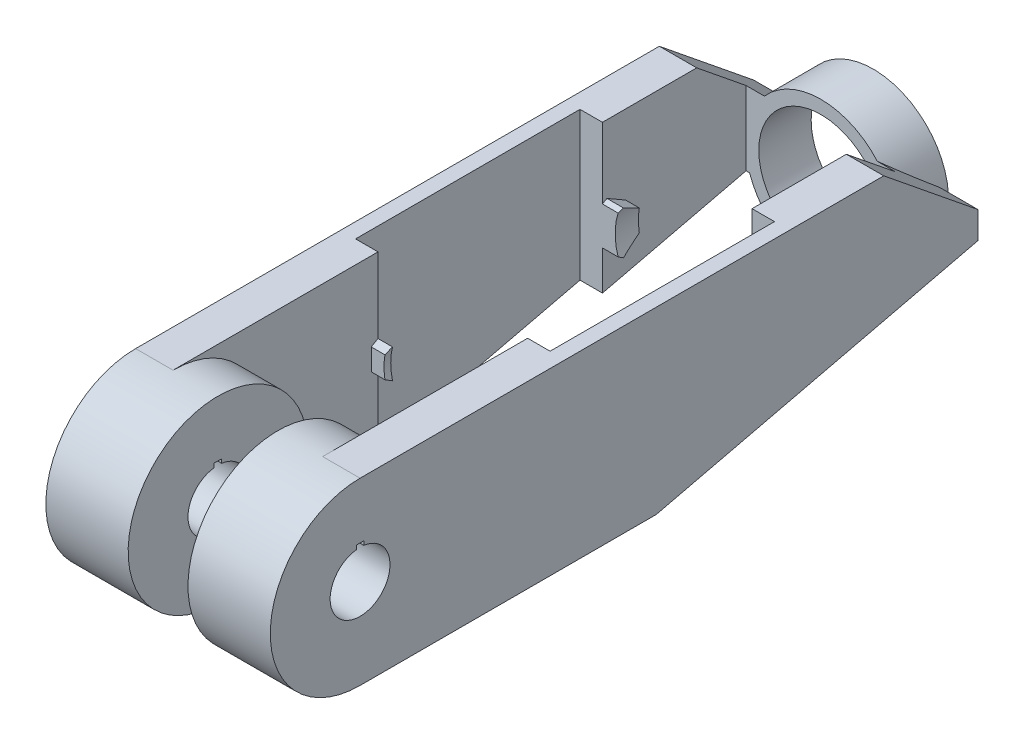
ISO-10303-21;
HEADER;
FILE_DESCRIPTION(('STEP AP214'),'2;1');
FILE_NAME('part.step','',(''),(''),'','','');
FILE_SCHEMA(('AUTOMOTIVE_DESIGN { 1 0 10303 214 1 1 1 1 }'));
ENDSEC;
DATA;
#1=APPLICATION_CONTEXT('core data for automotive mechanical design processes');
#2=APPLICATION_PROTOCOL_DEFINITION('international standard','automotive_design',2000,#1);
#3=PRODUCT_CONTEXT('',#1,'mechanical');
#4=PRODUCT('Part','Part','',(#3));
#5=PRODUCT_RELATED_PRODUCT_CATEGORY('part','',(#4));
#6=PRODUCT_DEFINITION_FORMATION('','',#4);
#7=PRODUCT_DEFINITION_CONTEXT('part definition',#1,'design');
#8=PRODUCT_DEFINITION('design','',#6,#7);
#9=PRODUCT_DEFINITION_SHAPE('','',#8);
#10=(LENGTH_UNIT() NAMED_UNIT(*) SI_UNIT(.MILLI.,.METRE.));
#11=(NAMED_UNIT(*) PLANE_ANGLE_UNIT() SI_UNIT($,.RADIAN.));
#12=(NAMED_UNIT(*) SI_UNIT($,.STERADIAN.) SOLID_ANGLE_UNIT());
#13=UNCERTAINTY_MEASURE_WITH_UNIT(LENGTH_MEASURE(1.E-05),#10,'distance_accuracy_value','');
#14=(GEOMETRIC_REPRESENTATION_CONTEXT(3) GLOBAL_UNCERTAINTY_ASSIGNED_CONTEXT((#13)) GLOBAL_UNIT_ASSIGNED_CONTEXT((#10,
#11,#12)) REPRESENTATION_CONTEXT('',''));
#15=CARTESIAN_POINT('',(0.,0.,0.));
#16=DIRECTION('',(0.,0.,1.));
#17=DIRECTION('',(1.,0.,0.));
#18=AXIS2_PLACEMENT_3D('',#15,#16,#17);
#19=CARTESIAN_POINT('',(75.,8.98360590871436,-413.));
#20=DIRECTION('',(0.,0.,1.));
#21=DIRECTION('',(1.,0.,0.));
#22=AXIS2_PLACEMENT_3D('',#19,#20,#21);
#23=PLANE('',#22);
#24=CARTESIAN_POINT('',(0.,0.,-413.));
#25=DIRECTION('',(0.,0.,-1.));
#26=DIRECTION('',(-1.,0.,0.));
#27=AXIS2_PLACEMENT_3D('',#24,#25,#26);
#28=CIRCLE('',#27,50.3115294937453);
#29=CARTESIAN_POINT('',(49.5029779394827,8.98360590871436,-413.));
#30=VERTEX_POINT('',#29);
#31=CARTESIAN_POINT('',(49.5029779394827,-8.98360590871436,-413.));
#32=VERTEX_POINT('',#31);
#33=EDGE_CURVE('E426',#30,#32,#28,.T.);
#34=ORIENTED_EDGE('',*,*,#33,.F.);
#35=DIRECTION('',(-1.,0.,0.));
#36=VECTOR('',#35,1.);
#37=CARTESIAN_POINT('',(75.,8.98360590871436,-413.));
#38=LINE('',#37,#36);
#39=CARTESIAN_POINT('',(75.,8.98360590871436,-413.));
#40=VERTEX_POINT('',#39);
#41=EDGE_CURVE('E704',#40,#30,#38,.T.);
#42=ORIENTED_EDGE('',*,*,#41,.F.);
#43=DIRECTION('',(0.,1.,0.));
#44=VECTOR('',#43,1.);
#45=CARTESIAN_POINT('',(75.,8.98360590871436,-413.));
#46=LINE('',#45,#44);
#47=CARTESIAN_POINT('',(75.,-8.98360590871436,-413.));
#48=VERTEX_POINT('',#47);
#49=EDGE_CURVE('E673',#48,#40,#46,.T.);
#50=ORIENTED_EDGE('',*,*,#49,.F.);
#51=DIRECTION('',(-1.,0.,0.));
#52=VECTOR('',#51,1.);
#53=CARTESIAN_POINT('',(75.,-8.98360590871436,-413.));
#54=LINE('',#53,#52);
#55=EDGE_CURVE('E708',#48,#32,#54,.T.);
#56=ORIENTED_EDGE('',*,*,#55,.T.);
#57=EDGE_LOOP('',(#34,#42,#50,#56));
#58=FACE_BOUND('',#57,.T.);
#59=ADVANCED_FACE('F40',(#58),#23,.F.);
#60=CARTESIAN_POINT('',(-50.,0.,0.));
#61=DIRECTION('',(1.,0.,0.));
#62=DIRECTION('',(0.,0.,-1.));
#63=AXIS2_PLACEMENT_3D('',#60,#61,#62);
#64=PLANE('',#63);
#65=DIRECTION('',(0.,1.,0.));
#66=VECTOR('',#65,1.);
#67=CARTESIAN_POINT('',(-50.,0.,-287.));
#68=LINE('',#67,#66);
#69=CARTESIAN_POINT('',(-50.,-38.8815857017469,-287.));
#70=VERTEX_POINT('',#69);
#71=CARTESIAN_POINT('',(-50.,-12.7017059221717,-287.));
#72=VERTEX_POINT('',#71);
#73=EDGE_CURVE('E505',#70,#72,#68,.T.);
#74=ORIENTED_EDGE('',*,*,#73,.F.);
#75=DIRECTION('',(0.,0.230874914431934,-0.972983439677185));
#76=VECTOR('',#75,1.);
#77=CARTESIAN_POINT('',(-50.,-60.,-198.));
#78=LINE('',#77,#76);
#79=CARTESIAN_POINT('',(-50.,-16.1021725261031,-383.));
#80=VERTEX_POINT('',#79);
#81=EDGE_CURVE('E638',#70,#80,#78,.T.);
#82=ORIENTED_EDGE('',*,*,#81,.T.);
#83=DIRECTION('',(0.,1.,0.));
#84=VECTOR('',#83,1.);
#85=CARTESIAN_POINT('',(-50.,-16.1021725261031,-383.));
#86=LINE('',#85,#84);
#87=CARTESIAN_POINT('',(-50.,33.2771269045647,-383.));
#88=VERTEX_POINT('',#87);
#89=EDGE_CURVE('E640',#80,#88,#86,.T.);
#90=ORIENTED_EDGE('',*,*,#89,.T.);
#91=DIRECTION('',(0.,0.629320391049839,0.77714596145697));
#92=VECTOR('',#91,1.);
#93=CARTESIAN_POINT('',(-50.,60.,-350.));
#94=LINE('',#93,#92);
#95=CARTESIAN_POINT('',(-50.,60.,-350.));
#96=VERTEX_POINT('',#95);
#97=EDGE_CURVE('E662',#88,#96,#94,.T.);
#98=ORIENTED_EDGE('',*,*,#97,.T.);
#99=DIRECTION('',(0.,0.,1.));
#100=VECTOR('',#99,1.);
#101=CARTESIAN_POINT('',(-50.,60.,0.));
#102=LINE('',#101,#100);
#103=CARTESIAN_POINT('',(-50.,60.,-287.));
#104=VERTEX_POINT('',#103);
#105=EDGE_CURVE('E724',#96,#104,#102,.T.);
#106=ORIENTED_EDGE('',*,*,#105,.T.);
#107=CARTESIAN_POINT('',(-50.,12.7017059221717,-287.));
#108=VERTEX_POINT('',#107);
#109=EDGE_CURVE('E502',#108,#104,#68,.T.);
#110=ORIENTED_EDGE('',*,*,#109,.F.);
#111=DIRECTION('',(0.,-0.5,0.866025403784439));
#112=VECTOR('',#111,1.);
#113=CARTESIAN_POINT('',(-50.,7.21687836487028,-277.5));
#114=LINE('',#113,#112);
#115=CARTESIAN_POINT('',(-50.,14.4337567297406,-290.));
#116=VERTEX_POINT('',#115);
#117=EDGE_CURVE('E605',#116,#108,#114,.T.);
#118=ORIENTED_EDGE('',*,*,#117,.F.);
#119=DIRECTION('',(0.,0.5,0.866025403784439));
#120=VECTOR('',#119,1.);
#121=CARTESIAN_POINT('',(-50.,14.4337567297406,-290.));
#122=LINE('',#121,#120);
#123=CARTESIAN_POINT('',(-50.,7.21687836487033,-302.5));
#124=VERTEX_POINT('',#123);
#125=EDGE_CURVE('E603',#124,#116,#122,.T.);
#126=ORIENTED_EDGE('',*,*,#125,.F.);
#127=DIRECTION('',(0.,1.,0.));
#128=VECTOR('',#127,1.);
#129=CARTESIAN_POINT('',(-50.,7.21687836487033,-302.5));
#130=LINE('',#129,#128);
#131=CARTESIAN_POINT('',(-50.,-7.2168783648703,-302.5));
#132=VERTEX_POINT('',#131);
#133=EDGE_CURVE('E601',#132,#124,#130,.T.);
#134=ORIENTED_EDGE('',*,*,#133,.F.);
#135=DIRECTION('',(0.,0.500000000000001,-0.866025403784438));
#136=VECTOR('',#135,1.);
#137=CARTESIAN_POINT('',(-50.,-7.2168783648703,-302.5));
#138=LINE('',#137,#136);
#139=CARTESIAN_POINT('',(-50.,-14.4337567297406,-290.));
#140=VERTEX_POINT('',#139);
#141=EDGE_CURVE('E599',#140,#132,#138,.T.);
#142=ORIENTED_EDGE('',*,*,#141,.F.);
#143=DIRECTION('',(0.,-0.5,-0.866025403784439));
#144=VECTOR('',#143,1.);
#145=CARTESIAN_POINT('',(-50.,-14.4337567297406,-290.));
#146=LINE('',#145,#144);
#147=EDGE_CURVE('E608',#72,#140,#146,.T.);
#148=ORIENTED_EDGE('',*,*,#147,.F.);
#149=EDGE_LOOP('',(#74,#82,#90,#98,#106,#110,#118,#126,#134,#142,#148));
#150=FACE_BOUND('',#149,.T.);
#151=ADVANCED_FACE('F775',(#150),#64,.T.);
#152=CARTESIAN_POINT('',(50.,0.,0.));
#153=DIRECTION('',(1.,0.,0.));
#154=DIRECTION('',(0.,0.,-1.));
#155=AXIS2_PLACEMENT_3D('',#152,#153,#154);
#156=PLANE('',#155);
#157=DIRECTION('',(0.,0.230874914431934,-0.972983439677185));
#158=VECTOR('',#157,1.);
#159=CARTESIAN_POINT('',(50.,-60.,-198.));
#160=LINE('',#159,#158);
#161=CARTESIAN_POINT('',(50.,-38.8815857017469,-287.));
#162=VERTEX_POINT('',#161);
#163=CARTESIAN_POINT('',(50.,-16.1021725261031,-383.));
#164=VERTEX_POINT('',#163);
#165=EDGE_CURVE('E635',#162,#164,#160,.T.);
#166=ORIENTED_EDGE('',*,*,#165,.F.);
#167=DIRECTION('',(0.,1.,0.));
#168=VECTOR('',#167,1.);
#169=CARTESIAN_POINT('',(50.,0.,-287.));
#170=LINE('',#169,#168);
#171=CARTESIAN_POINT('',(50.,-12.7017059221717,-287.));
#172=VERTEX_POINT('',#171);
#173=EDGE_CURVE('E486',#162,#172,#170,.T.);
#174=ORIENTED_EDGE('',*,*,#173,.T.);
#175=DIRECTION('',(0.,0.5,0.866025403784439));
#176=VECTOR('',#175,1.);
#177=CARTESIAN_POINT('',(50.,-14.4337567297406,-290.));
#178=LINE('',#177,#176);
#179=CARTESIAN_POINT('',(50.,-14.4337567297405,-290.));
#180=VERTEX_POINT('',#179);
#181=EDGE_CURVE('E571',#180,#172,#178,.T.);
#182=ORIENTED_EDGE('',*,*,#181,.F.);
#183=DIRECTION('',(0.,-0.500000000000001,0.866025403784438));
#184=VECTOR('',#183,1.);
#185=CARTESIAN_POINT('',(50.,-7.2168783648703,-302.5));
#186=LINE('',#185,#184);
#187=CARTESIAN_POINT('',(50.,-7.2168783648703,-302.5));
#188=VERTEX_POINT('',#187);
#189=EDGE_CURVE('E577',#188,#180,#186,.T.);
#190=ORIENTED_EDGE('',*,*,#189,.F.);
#191=DIRECTION('',(0.,-1.,0.));
#192=VECTOR('',#191,1.);
#193=CARTESIAN_POINT('',(50.,7.21687836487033,-302.5));
#194=LINE('',#193,#192);
#195=CARTESIAN_POINT('',(50.,7.21687836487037,-302.5));
#196=VERTEX_POINT('',#195);
#197=EDGE_CURVE('E574',#196,#188,#194,.T.);
#198=ORIENTED_EDGE('',*,*,#197,.F.);
#199=DIRECTION('',(0.,-0.5,-0.866025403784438));
#200=VECTOR('',#199,1.);
#201=CARTESIAN_POINT('',(50.,14.4337567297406,-290.));
#202=LINE('',#201,#200);
#203=CARTESIAN_POINT('',(50.,14.4337567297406,-290.));
#204=VERTEX_POINT('',#203);
#205=EDGE_CURVE('E570',#204,#196,#202,.T.);
#206=ORIENTED_EDGE('',*,*,#205,.F.);
#207=DIRECTION('',(0.,0.5,-0.866025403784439));
#208=VECTOR('',#207,1.);
#209=CARTESIAN_POINT('',(50.,7.21687836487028,-277.5));
#210=LINE('',#209,#208);
#211=CARTESIAN_POINT('',(50.,12.7017059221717,-287.));
#212=VERTEX_POINT('',#211);
#213=EDGE_CURVE('E568',#212,#204,#210,.T.);
#214=ORIENTED_EDGE('',*,*,#213,.F.);
#215=CARTESIAN_POINT('',(50.,60.,-287.));
#216=VERTEX_POINT('',#215);
#217=EDGE_CURVE('E490',#212,#216,#170,.T.);
#218=ORIENTED_EDGE('',*,*,#217,.T.);
#219=DIRECTION('',(0.,0.,1.));
#220=VECTOR('',#219,1.);
#221=CARTESIAN_POINT('',(50.,60.,0.));
#222=LINE('',#221,#220);
#223=CARTESIAN_POINT('',(50.,60.,-350.));
#224=VERTEX_POINT('',#223);
#225=EDGE_CURVE('E720',#224,#216,#222,.T.);
#226=ORIENTED_EDGE('',*,*,#225,.F.);
#227=DIRECTION('',(0.,0.629320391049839,0.77714596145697));
#228=VECTOR('',#227,1.);
#229=CARTESIAN_POINT('',(50.,60.,-350.));
#230=LINE('',#229,#228);
#231=CARTESIAN_POINT('',(50.,33.2771269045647,-383.));
#232=VERTEX_POINT('',#231);
#233=EDGE_CURVE('E659',#232,#224,#230,.T.);
#234=ORIENTED_EDGE('',*,*,#233,.F.);
#235=DIRECTION('',(0.,1.,0.));
#236=VECTOR('',#235,1.);
#237=CARTESIAN_POINT('',(50.,-16.1021725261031,-383.));
#238=LINE('',#237,#236);
#239=EDGE_CURVE('E650',#164,#232,#238,.T.);
#240=ORIENTED_EDGE('',*,*,#239,.F.);
#241=EDGE_LOOP('',(#166,#174,#182,#190,#198,#206,#214,#218,#226,#234,#240));
#242=FACE_BOUND('',#241,.T.);
#243=ADVANCED_FACE('F782',(#242),#156,.F.);
#244=CARTESIAN_POINT('',(-75.002,-14.4337567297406,-145.));
#245=DIRECTION('',(0.,0.866025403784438,-0.5));
#246=DIRECTION('',(0.,0.5,0.866025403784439));
#247=AXIS2_PLACEMENT_3D('',#244,#245,#246);
#248=PLANE('',#247);
#249=DIRECTION('',(0.,-0.5,-0.866025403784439));
#250=VECTOR('',#249,1.);
#251=CARTESIAN_POINT('',(-50.,-14.4337567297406,-145.));
#252=LINE('',#251,#250);
#253=CARTESIAN_POINT('',(-50.,-7.21687836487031,-132.5));
#254=VERTEX_POINT('',#253);
#255=CARTESIAN_POINT('',(-50.,-9.81495457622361,-137.));
#256=VERTEX_POINT('',#255);
#257=EDGE_CURVE('E630',#254,#256,#252,.T.);
#258=ORIENTED_EDGE('',*,*,#257,.T.);
#259=DIRECTION('',(1.,0.,0.));
#260=VECTOR('',#259,1.);
#261=CARTESIAN_POINT('',(-75.002,-9.81495457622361,-137.));
#262=LINE('',#261,#260);
#263=CARTESIAN_POINT('',(-40.3234319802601,-9.81495457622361,-137.));
#264=VERTEX_POINT('',#263);
#265=EDGE_CURVE('E479',#256,#264,#262,.T.);
#266=ORIENTED_EDGE('',*,*,#265,.T.);
#267=CARTESIAN_POINT('',(0.,0.,-120.));
#268=DIRECTION('',(0.,0.866025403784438,-0.5));
#269=DIRECTION('',(0.,-0.5,-0.866025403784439));
#270=AXIS2_PLACEMENT_3D('',#267,#268,#269);
#271=ELLIPSE('',#270,83.0015060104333,41.5007530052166);
#272=CARTESIAN_POINT('',(-40.8684372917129,-7.21687836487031,-132.5));
#273=VERTEX_POINT('',#272);
#274=EDGE_CURVE('E543',#264,#273,#271,.T.);
#275=ORIENTED_EDGE('',*,*,#274,.T.);
#276=DIRECTION('',(1.,0.,0.));
#277=VECTOR('',#276,1.);
#278=CARTESIAN_POINT('',(-75.002,-7.21687836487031,-132.5));
#279=LINE('',#278,#277);
#280=EDGE_CURVE('E623',#254,#273,#279,.T.);
#281=ORIENTED_EDGE('',*,*,#280,.F.);
#282=EDGE_LOOP('',(#258,#266,#275,#281));
#283=FACE_BOUND('',#282,.T.);
#284=ADVANCED_FACE('F938',(#283),#248,.F.);
#285=CARTESIAN_POINT('',(-75.002,7.2168783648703,-132.5));
#286=DIRECTION('',(0.,-0.866025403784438,-0.500000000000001));
#287=DIRECTION('',(0.,0.500000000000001,-0.866025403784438));
#288=AXIS2_PLACEMENT_3D('',#285,#286,#287);
#289=PLANE('',#288);
#290=DIRECTION('',(0.,0.500000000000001,-0.866025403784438));
#291=VECTOR('',#290,1.);
#292=CARTESIAN_POINT('',(50.,7.2168783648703,-132.5));
#293=LINE('',#292,#291);
#294=CARTESIAN_POINT('',(50.,7.2168783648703,-132.5));
#295=VERTEX_POINT('',#294);
#296=CARTESIAN_POINT('',(50.,9.81495457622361,-137.));
#297=VERTEX_POINT('',#296);
#298=EDGE_CURVE('E614',#295,#297,#293,.T.);
#299=ORIENTED_EDGE('',*,*,#298,.T.);
#300=DIRECTION('',(-1.,0.,0.));
#301=VECTOR('',#300,1.);
#302=CARTESIAN_POINT('',(-75.002,9.81495457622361,-137.));
#303=LINE('',#302,#301);
#304=CARTESIAN_POINT('',(40.3234319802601,9.8149545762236,-137.));
#305=VERTEX_POINT('',#304);
#306=EDGE_CURVE('E467',#297,#305,#303,.T.);
#307=ORIENTED_EDGE('',*,*,#306,.T.);
#308=CARTESIAN_POINT('',(0.,0.,-120.));
#309=DIRECTION('',(0.,-0.866025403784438,-0.500000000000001));
#310=DIRECTION('',(0.,0.500000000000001,-0.866025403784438));
#311=AXIS2_PLACEMENT_3D('',#308,#309,#310);
#312=ELLIPSE('',#311,83.0015060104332,41.5007530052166);
#313=CARTESIAN_POINT('',(40.8684372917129,7.2168783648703,-132.5));
#314=VERTEX_POINT('',#313);
#315=EDGE_CURVE('E544',#305,#314,#312,.T.);
#316=ORIENTED_EDGE('',*,*,#315,.T.);
#317=DIRECTION('',(1.,0.,0.));
#318=VECTOR('',#317,1.);
#319=CARTESIAN_POINT('',(-75.002,7.2168783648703,-132.5));
#320=LINE('',#319,#318);
#321=EDGE_CURVE('E617',#314,#295,#320,.T.);
#322=ORIENTED_EDGE('',*,*,#321,.T.);
#323=EDGE_LOOP('',(#299,#307,#316,#322));
#324=FACE_BOUND('',#323,.T.);
#325=ADVANCED_FACE('F931',(#324),#289,.F.);
#326=CARTESIAN_POINT('',(-75.002,-7.21687836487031,-132.5));
#327=DIRECTION('',(0.,0.,-1.));
#328=DIRECTION('',(-1.,0.,0.));
#329=AXIS2_PLACEMENT_3D('',#326,#327,#328);
#330=PLANE('',#329);
#331=ORIENTED_EDGE('',*,*,#321,.F.);
#332=CARTESIAN_POINT('',(0.,0.,-132.5));
#333=DIRECTION('',(0.,0.,-1.));
#334=DIRECTION('',(-1.,0.,0.));
#335=AXIS2_PLACEMENT_3D('',#332,#333,#334);
#336=CIRCLE('',#335,41.5007530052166);
#337=CARTESIAN_POINT('',(40.8684372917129,-7.21687836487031,-132.5));
#338=VERTEX_POINT('',#337);
#339=EDGE_CURVE('E520',#338,#314,#336,.F.);
#340=ORIENTED_EDGE('',*,*,#339,.F.);
#341=CARTESIAN_POINT('',(50.,-7.21687836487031,-132.5));
#342=VERTEX_POINT('',#341);
#343=EDGE_CURVE('E622',#338,#342,#279,.T.);
#344=ORIENTED_EDGE('',*,*,#343,.T.);
#345=DIRECTION('',(0.,1.,0.));
#346=VECTOR('',#345,1.);
#347=CARTESIAN_POINT('',(50.,-7.21687836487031,-132.5));
#348=LINE('',#347,#346);
#349=EDGE_CURVE('E611',#342,#295,#348,.T.);
#350=ORIENTED_EDGE('',*,*,#349,.T.);
#351=EDGE_LOOP('',(#331,#340,#344,#350));
#352=FACE_BOUND('',#351,.T.);
#353=ADVANCED_FACE('F935',(#352),#330,.F.);
#354=CARTESIAN_POINT('',(-75.002,-7.2168783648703,-302.5));
#355=DIRECTION('',(0.,0.866025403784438,0.500000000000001));
#356=DIRECTION('',(0.,-0.500000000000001,0.866025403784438));
#357=AXIS2_PLACEMENT_3D('',#354,#355,#356);
#358=PLANE('',#357);
#359=DIRECTION('',(1.,0.,0.));
#360=VECTOR('',#359,1.);
#361=CARTESIAN_POINT('',(-75.002,-7.2168783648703,-302.5));
#362=LINE('',#361,#360);
#363=CARTESIAN_POINT('',(-40.8684372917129,-7.2168783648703,-302.5));
#364=VERTEX_POINT('',#363);
#365=EDGE_CURVE('E588',#132,#364,#362,.T.);
#366=ORIENTED_EDGE('',*,*,#365,.T.);
#367=CARTESIAN_POINT('',(0.,0.,-315.));
#368=DIRECTION('',(0.,0.866025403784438,0.500000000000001));
#369=DIRECTION('',(0.,0.500000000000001,-0.866025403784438));
#370=AXIS2_PLACEMENT_3D('',#367,#368,#369);
#371=ELLIPSE('',#370,83.0015060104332,41.5007530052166);
#372=CARTESIAN_POINT('',(-38.909885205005,-14.4337567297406,-290.));
#373=VERTEX_POINT('',#372);
#374=EDGE_CURVE('E535',#364,#373,#371,.T.);
#375=ORIENTED_EDGE('',*,*,#374,.T.);
#376=DIRECTION('',(1.,0.,0.));
#377=VECTOR('',#376,1.);
#378=CARTESIAN_POINT('',(-75.002,-14.4337567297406,-290.));
#379=LINE('',#378,#377);
#380=EDGE_CURVE('E584',#140,#373,#379,.T.);
#381=ORIENTED_EDGE('',*,*,#380,.F.);
#382=ORIENTED_EDGE('',*,*,#141,.T.);
#383=EDGE_LOOP('',(#366,#375,#381,#382));
#384=FACE_BOUND('',#383,.T.);
#385=ADVANCED_FACE('F912',(#384),#358,.F.);
#386=CARTESIAN_POINT('',(-75.002,7.21687836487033,-302.5));
#387=DIRECTION('',(0.,0.,1.));
#388=DIRECTION('',(1.,0.,0.));
#389=AXIS2_PLACEMENT_3D('',#386,#387,#388);
#390=PLANE('',#389);
#391=DIRECTION('',(1.,0.,0.));
#392=VECTOR('',#391,1.);
#393=CARTESIAN_POINT('',(-75.002,7.21687836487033,-302.5));
#394=LINE('',#393,#392);
#395=CARTESIAN_POINT('',(-40.8684372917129,7.21687836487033,-302.5));
#396=VERTEX_POINT('',#395);
#397=EDGE_CURVE('E592',#124,#396,#394,.T.);
#398=ORIENTED_EDGE('',*,*,#397,.T.);
#399=CARTESIAN_POINT('',(0.,0.,-302.5));
#400=DIRECTION('',(0.,0.,1.));
#401=DIRECTION('',(1.,0.,0.));
#402=AXIS2_PLACEMENT_3D('',#399,#400,#401);
#403=CIRCLE('',#402,41.5007530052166);
#404=EDGE_CURVE('E531',#396,#364,#403,.T.);
#405=ORIENTED_EDGE('',*,*,#404,.T.);
#406=ORIENTED_EDGE('',*,*,#365,.F.);
#407=ORIENTED_EDGE('',*,*,#133,.T.);
#408=EDGE_LOOP('',(#398,#405,#406,#407));
#409=FACE_BOUND('',#408,.T.);
#410=ADVANCED_FACE('F916',(#409),#390,.F.);
#411=CARTESIAN_POINT('',(-75.002,14.4337567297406,-290.));
#412=DIRECTION('',(0.,-0.866025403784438,0.5));
#413=DIRECTION('',(0.,-0.5,-0.866025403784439));
#414=AXIS2_PLACEMENT_3D('',#411,#412,#413);
#415=PLANE('',#414);
#416=CARTESIAN_POINT('',(40.8684372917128,7.21687836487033,-302.5));
#417=VERTEX_POINT('',#416);
#418=EDGE_CURVE('E591',#417,#196,#394,.T.);
#419=ORIENTED_EDGE('',*,*,#418,.F.);
#420=CARTESIAN_POINT('',(0.,0.,-315.));
#421=DIRECTION('',(0.,-0.866025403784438,0.5));
#422=DIRECTION('',(0.,-0.5,-0.866025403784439));
#423=AXIS2_PLACEMENT_3D('',#420,#421,#422);
#424=ELLIPSE('',#423,83.0015060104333,41.5007530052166);
#425=CARTESIAN_POINT('',(38.909885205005,14.4337567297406,-290.));
#426=VERTEX_POINT('',#425);
#427=EDGE_CURVE('E532',#417,#426,#424,.T.);
#428=ORIENTED_EDGE('',*,*,#427,.T.);
#429=DIRECTION('',(1.,0.,0.));
#430=VECTOR('',#429,1.);
#431=CARTESIAN_POINT('',(-75.002,14.4337567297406,-290.));
#432=LINE('',#431,#430);
#433=EDGE_CURVE('E595',#426,#204,#432,.T.);
#434=ORIENTED_EDGE('',*,*,#433,.T.);
#435=ORIENTED_EDGE('',*,*,#205,.T.);
#436=EDGE_LOOP('',(#419,#428,#434,#435));
#437=FACE_BOUND('',#436,.T.);
#438=ADVANCED_FACE('F875',(#437),#415,.F.);
#439=CARTESIAN_POINT('',(-75.002,-14.4337567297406,-290.));
#440=DIRECTION('',(0.,0.866025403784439,-0.5));
#441=DIRECTION('',(0.,0.5,0.866025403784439));
#442=AXIS2_PLACEMENT_3D('',#439,#440,#441);
#443=PLANE('',#442);
#444=CARTESIAN_POINT('',(0.,0.,-265.));
#445=DIRECTION('',(0.,0.866025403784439,-0.5));
#446=DIRECTION('',(0.,-0.5,-0.866025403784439));
#447=AXIS2_PLACEMENT_3D('',#444,#445,#446);
#448=ELLIPSE('',#447,83.0015060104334,41.5007530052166);
#449=CARTESIAN_POINT('',(-39.5092288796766,-12.7017059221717,-287.));
#450=VERTEX_POINT('',#449);
#451=EDGE_CURVE('E523',#373,#450,#448,.T.);
#452=ORIENTED_EDGE('',*,*,#451,.T.);
#453=DIRECTION('',(-1.,0.,0.));
#454=VECTOR('',#453,1.);
#455=CARTESIAN_POINT('',(-75.002,-12.7017059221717,-287.));
#456=LINE('',#455,#454);
#457=EDGE_CURVE('E504',#450,#72,#456,.T.);
#458=ORIENTED_EDGE('',*,*,#457,.T.);
#459=ORIENTED_EDGE('',*,*,#147,.T.);
#460=ORIENTED_EDGE('',*,*,#380,.T.);
#461=EDGE_LOOP('',(#452,#458,#459,#460));
#462=FACE_BOUND('',#461,.T.);
#463=ADVANCED_FACE('F926',(#462),#443,.F.);
#464=CARTESIAN_POINT('',(-75.002,7.21687836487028,-277.5));
#465=DIRECTION('',(0.,-0.866025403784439,-0.5));
#466=DIRECTION('',(0.,0.5,-0.866025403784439));
#467=AXIS2_PLACEMENT_3D('',#464,#465,#466);
#468=PLANE('',#467);
#469=CARTESIAN_POINT('',(0.,0.,-265.));
#470=DIRECTION('',(0.,-0.866025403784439,-0.5));
#471=DIRECTION('',(0.,0.5,-0.866025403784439));
#472=AXIS2_PLACEMENT_3D('',#469,#470,#471);
#473=ELLIPSE('',#472,83.0015060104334,41.5007530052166);
#474=CARTESIAN_POINT('',(39.5092288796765,12.7017059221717,-287.));
#475=VERTEX_POINT('',#474);
#476=EDGE_CURVE('E524',#426,#475,#473,.T.);
#477=ORIENTED_EDGE('',*,*,#476,.T.);
#478=DIRECTION('',(1.,0.,0.));
#479=VECTOR('',#478,1.);
#480=CARTESIAN_POINT('',(-75.002,12.7017059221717,-287.));
#481=LINE('',#480,#479);
#482=EDGE_CURVE('E489',#475,#212,#481,.T.);
#483=ORIENTED_EDGE('',*,*,#482,.T.);
#484=ORIENTED_EDGE('',*,*,#213,.T.);
#485=ORIENTED_EDGE('',*,*,#433,.F.);
#486=EDGE_LOOP('',(#477,#483,#484,#485));
#487=FACE_BOUND('',#486,.T.);
#488=ADVANCED_FACE('F881',(#487),#468,.F.);
#489=CARTESIAN_POINT('',(75.,-8.98360590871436,-413.));
#490=DIRECTION('',(0.,0.972983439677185,0.230874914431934));
#491=DIRECTION('',(0.,-0.230874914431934,0.972983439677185));
#492=AXIS2_PLACEMENT_3D('',#489,#490,#491);
#493=PLANE('',#492);
#494=DIRECTION('',(-1.,0.,0.));
#495=VECTOR('',#494,1.);
#496=CARTESIAN_POINT('',(75.,-38.8815857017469,-287.));
#497=LINE('',#496,#495);
#498=CARTESIAN_POINT('',(-65.,-38.8815857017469,-287.));
#499=VERTEX_POINT('',#498);
#500=EDGE_CURVE('E508',#70,#499,#497,.T.);
#501=ORIENTED_EDGE('',*,*,#500,.T.);
#502=DIRECTION('',(0.,-0.230874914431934,0.972983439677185));
#503=VECTOR('',#502,1.);
#504=CARTESIAN_POINT('',(-65.,-8.98360590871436,-413.));
#505=LINE('',#504,#503);
#506=CARTESIAN_POINT('',(-65.,-60.,-198.));
#507=VERTEX_POINT('',#506);
#508=EDGE_CURVE('E514',#499,#507,#505,.T.);
#509=ORIENTED_EDGE('',*,*,#508,.T.);
#510=DIRECTION('',(-1.,0.,0.));
#511=VECTOR('',#510,1.);
#512=CARTESIAN_POINT('',(75.,-60.,-198.));
#513=LINE('',#512,#511);
#514=CARTESIAN_POINT('',(-75.,-60.,-198.));
#515=VERTEX_POINT('',#514);
#516=EDGE_CURVE('E711',#507,#515,#513,.T.);
#517=ORIENTED_EDGE('',*,*,#516,.T.);
#518=DIRECTION('',(0.,0.230874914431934,-0.972983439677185));
#519=VECTOR('',#518,1.);
#520=CARTESIAN_POINT('',(-75.,-8.98360590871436,-413.));
#521=LINE('',#520,#519);
#522=CARTESIAN_POINT('',(-75.,-8.98360590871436,-413.));
#523=VERTEX_POINT('',#522);
#524=EDGE_CURVE('E685',#515,#523,#521,.T.);
#525=ORIENTED_EDGE('',*,*,#524,.T.);
#526=CARTESIAN_POINT('',(-49.5029779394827,-8.98360590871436,-413.));
#527=VERTEX_POINT('',#526);
#528=EDGE_CURVE('E707',#527,#523,#54,.T.);
#529=ORIENTED_EDGE('',*,*,#528,.F.);
#530=CARTESIAN_POINT('',(0.,0.,-450.859893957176));
#531=DIRECTION('',(0.,0.972983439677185,0.230874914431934));
#532=DIRECTION('',(0.,0.230874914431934,-0.972983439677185));
#533=AXIS2_PLACEMENT_3D('',#530,#531,#532);
#534=ELLIPSE('',#533,217.916830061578,50.3115294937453);
#535=CARTESIAN_POINT('',(-47.6651868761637,-16.1021725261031,-383.));
#536=VERTEX_POINT('',#535);
#537=EDGE_CURVE('E560',#527,#536,#534,.T.);
#538=ORIENTED_EDGE('',*,*,#537,.T.);
#539=DIRECTION('',(1.,0.,0.));
#540=VECTOR('',#539,1.);
#541=CARTESIAN_POINT('',(-50.,-16.1021725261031,-383.));
#542=LINE('',#541,#540);
#543=EDGE_CURVE('E656',#80,#536,#542,.T.);
#544=ORIENTED_EDGE('',*,*,#543,.F.);
#545=ORIENTED_EDGE('',*,*,#81,.F.);
#546=EDGE_LOOP('',(#501,#509,#517,#525,#529,#538,#544,#545));
#547=FACE_BOUND('',#546,.T.);
#548=ADVANCED_FACE('F766',(#547),#493,.F.);
#549=CARTESIAN_POINT('',(75.,60.,-350.));
#550=DIRECTION('',(0.,-0.77714596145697,0.629320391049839));
#551=DIRECTION('',(0.,-0.629320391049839,-0.77714596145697));
#552=AXIS2_PLACEMENT_3D('',#549,#550,#551);
#553=PLANE('',#552);
#554=ORIENTED_EDGE('',*,*,#41,.T.);
#555=CARTESIAN_POINT('',(0.,0.,-424.093829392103));
#556=DIRECTION('',(0.,-0.77714596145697,0.629320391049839));
#557=DIRECTION('',(0.,-0.629320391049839,-0.77714596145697));
#558=AXIS2_PLACEMENT_3D('',#555,#556,#557);
#559=ELLIPSE('',#558,79.9458117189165,50.3115294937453);
#560=CARTESIAN_POINT('',(37.7343719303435,33.2771269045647,-383.));
#561=VERTEX_POINT('',#560);
#562=EDGE_CURVE('E557',#30,#561,#559,.T.);
#563=ORIENTED_EDGE('',*,*,#562,.T.);
#564=DIRECTION('',(1.,0.,0.));
#565=VECTOR('',#564,1.);
#566=CARTESIAN_POINT('',(75.,33.2771269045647,-383.));
#567=LINE('',#566,#565);
#568=EDGE_CURVE('E727',#561,#232,#567,.T.);
#569=ORIENTED_EDGE('',*,*,#568,.T.);
#570=ORIENTED_EDGE('',*,*,#233,.T.);
#571=DIRECTION('',(-1.,0.,0.));
#572=VECTOR('',#571,1.);
#573=CARTESIAN_POINT('',(75.,60.,-350.));
#574=LINE('',#573,#572);
#575=CARTESIAN_POINT('',(75.,60.,-350.));
#576=VERTEX_POINT('',#575);
#577=EDGE_CURVE('E700',#576,#224,#574,.T.);
#578=ORIENTED_EDGE('',*,*,#577,.F.);
#579=DIRECTION('',(0.,0.629320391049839,0.77714596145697));
#580=VECTOR('',#579,1.);
#581=CARTESIAN_POINT('',(75.,60.,-350.));
#582=LINE('',#581,#580);
#583=EDGE_CURVE('E675',#40,#576,#582,.T.);
#584=ORIENTED_EDGE('',*,*,#583,.F.);
#585=EDGE_LOOP('',(#554,#563,#569,#570,#578,#584));
#586=FACE_BOUND('',#585,.T.);
#587=ADVANCED_FACE('F757',(#586),#553,.F.);
#588=CARTESIAN_POINT('',(75.,0.,0.));
#589=DIRECTION('',(-1.,0.,0.));
#590=DIRECTION('',(0.,0.,1.));
#591=AXIS2_PLACEMENT_3D('',#588,#589,#590);
#592=CYLINDRICAL_SURFACE('',#591,60.);
#593=CARTESIAN_POINT('',(-75.,0.,0.));
#594=DIRECTION('',(1.,0.,0.));
#595=DIRECTION('',(0.,0.,1.));
#596=AXIS2_PLACEMENT_3D('',#593,#594,#595);
#597=CIRCLE('',#596,60.);
#598=CARTESIAN_POINT('',(-75.,60.,0.));
#599=VERTEX_POINT('',#598);
#600=CARTESIAN_POINT('',(-75.,-60.,0.));
#601=VERTEX_POINT('',#600);
#602=EDGE_CURVE('E664',#599,#601,#597,.T.);
#603=ORIENTED_EDGE('',*,*,#602,.T.);
#604=DIRECTION('',(-1.,0.,0.));
#605=VECTOR('',#604,1.);
#606=CARTESIAN_POINT('',(75.,-60.,0.));
#607=LINE('',#606,#605);
#608=CARTESIAN_POINT('',(-50.,-60.,0.));
#609=VERTEX_POINT('',#608);
#610=EDGE_CURVE('E715',#609,#601,#607,.T.);
#611=ORIENTED_EDGE('',*,*,#610,.F.);
#612=CARTESIAN_POINT('',(-50.,0.,0.));
#613=DIRECTION('',(-1.,0.,0.));
#614=DIRECTION('',(0.,0.,-1.));
#615=AXIS2_PLACEMENT_3D('',#612,#613,#614);
#616=CIRCLE('',#615,60.);
#617=CARTESIAN_POINT('',(-50.,60.,0.));
#618=VERTEX_POINT('',#617);
#619=EDGE_CURVE('E643',#618,#609,#616,.T.);
#620=ORIENTED_EDGE('',*,*,#619,.F.);
#621=DIRECTION('',(-1.,0.,0.));
#622=VECTOR('',#621,1.);
#623=CARTESIAN_POINT('',(75.,60.,0.));
#624=LINE('',#623,#622);
#625=EDGE_CURVE('E679',#618,#599,#624,.T.);
#626=ORIENTED_EDGE('',*,*,#625,.T.);
#627=EDGE_LOOP('',(#603,#611,#620,#626));
#628=FACE_BOUND('',#627,.T.);
#629=CARTESIAN_POINT('',(-20.,0.,0.));
#630=DIRECTION('',(1.,0.,0.));
#631=DIRECTION('',(0.,0.,-1.));
#632=AXIS2_PLACEMENT_3D('',#629,#630,#631);
#633=CIRCLE('',#632,60.);
#634=CARTESIAN_POINT('',(-20.,0.,-60.));
#635=VERTEX_POINT('',#634);
#636=EDGE_CURVE('E561',#635,#635,#633,.T.);
#637=ORIENTED_EDGE('',*,*,#636,.F.);
#638=EDGE_LOOP('',(#637));
#639=FACE_BOUND('',#638,.T.);
#640=ADVANCED_FACE('F755',(#628,#639),#592,.T.);
#641=CARTESIAN_POINT('',(-75.,0.,0.));
#642=DIRECTION('',(1.,0.,0.));
#643=DIRECTION('',(0.,0.,-1.));
#644=AXIS2_PLACEMENT_3D('',#641,#642,#643);
#645=CYLINDRICAL_SURFACE('',#644,20.);
#646=CARTESIAN_POINT('',(-20.,0.,0.));
#647=DIRECTION('',(1.,0.,0.));
#648=DIRECTION('',(0.,0.,-1.));
#649=AXIS2_PLACEMENT_3D('',#646,#647,#648);
#650=CIRCLE('',#649,20.);
#651=CARTESIAN_POINT('',(-20.,19.8431348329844,-2.5));
#652=VERTEX_POINT('',#651);
#653=CARTESIAN_POINT('',(-20.,19.8431348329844,2.5));
#654=VERTEX_POINT('',#653);
#655=EDGE_CURVE('E583',#652,#654,#650,.F.);
#656=ORIENTED_EDGE('',*,*,#655,.F.);
#657=DIRECTION('',(1.,0.,0.));
#658=VECTOR('',#657,1.);
#659=CARTESIAN_POINT('',(-75.,19.8431348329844,-2.5));
#660=LINE('',#659,#658);
#661=CARTESIAN_POINT('',(-75.,19.8431348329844,-2.5));
#662=VERTEX_POINT('',#661);
#663=EDGE_CURVE('E411',#652,#662,#660,.F.);
#664=ORIENTED_EDGE('',*,*,#663,.T.);
#665=CARTESIAN_POINT('',(-75.,0.,0.));
#666=DIRECTION('',(1.,0.,0.));
#667=DIRECTION('',(0.,0.,-1.));
#668=AXIS2_PLACEMENT_3D('',#665,#666,#667);
#669=CIRCLE('',#668,20.);
#670=CARTESIAN_POINT('',(-75.,19.8431348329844,2.5));
#671=VERTEX_POINT('',#670);
#672=EDGE_CURVE('E388',#671,#662,#669,.T.);
#673=ORIENTED_EDGE('',*,*,#672,.F.);
#674=DIRECTION('',(1.,0.,0.));
#675=VECTOR('',#674,1.);
#676=CARTESIAN_POINT('',(-75.,19.8431348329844,2.5));
#677=LINE('',#676,#675);
#678=EDGE_CURVE('E402',#671,#654,#677,.T.);
#679=ORIENTED_EDGE('',*,*,#678,.T.);
#680=EDGE_LOOP('',(#656,#664,#673,#679));
#681=FACE_BOUND('',#680,.T.);
#682=ADVANCED_FACE('F746',(#681),#645,.F.);
#683=DIRECTION('',(0.,-1.,0.));
#684=VECTOR('',#683,1.);
#685=CARTESIAN_POINT('',(-50.,0.,-137.));
#686=LINE('',#685,#684);
#687=CARTESIAN_POINT('',(-50.,60.,-137.));
#688=VERTEX_POINT('',#687);
#689=CARTESIAN_POINT('',(-50.,9.81495457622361,-137.));
#690=VERTEX_POINT('',#689);
#691=EDGE_CURVE('E477',#688,#690,#686,.T.);
#692=ORIENTED_EDGE('',*,*,#691,.F.);
#693=EDGE_CURVE('E723',#688,#618,#102,.T.);
#694=ORIENTED_EDGE('',*,*,#693,.T.);
#695=ORIENTED_EDGE('',*,*,#619,.T.);
#696=DIRECTION('',(0.,0.,-1.));
#697=VECTOR('',#696,1.);
#698=CARTESIAN_POINT('',(-50.,-60.,0.));
#699=LINE('',#698,#697);
#700=CARTESIAN_POINT('',(-50.,-60.,-137.));
#701=VERTEX_POINT('',#700);
#702=EDGE_CURVE('E645',#609,#701,#699,.T.);
#703=ORIENTED_EDGE('',*,*,#702,.T.);
#704=EDGE_CURVE('E480',#256,#701,#686,.T.);
#705=ORIENTED_EDGE('',*,*,#704,.F.);
#706=ORIENTED_EDGE('',*,*,#257,.F.);
#707=DIRECTION('',(0.,-1.,0.));
#708=VECTOR('',#707,1.);
#709=CARTESIAN_POINT('',(-50.,-7.21687836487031,-132.5));
#710=LINE('',#709,#708);
#711=CARTESIAN_POINT('',(-50.,7.2168783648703,-132.5));
#712=VERTEX_POINT('',#711);
#713=EDGE_CURVE('E628',#712,#254,#710,.T.);
#714=ORIENTED_EDGE('',*,*,#713,.F.);
#715=DIRECTION('',(0.,-0.500000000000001,0.866025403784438));
#716=VECTOR('',#715,1.);
#717=CARTESIAN_POINT('',(-50.,7.2168783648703,-132.5));
#718=LINE('',#717,#716);
#719=EDGE_CURVE('E626',#690,#712,#718,.T.);
#720=ORIENTED_EDGE('',*,*,#719,.F.);
#721=EDGE_LOOP('',(#692,#694,#695,#703,#705,#706,#714,#720));
#722=FACE_BOUND('',#721,.T.);
#723=ADVANCED_FACE('F763',(#722),#64,.T.);
#724=CARTESIAN_POINT('',(50.,60.,-137.));
#725=VERTEX_POINT('',#724);
#726=CARTESIAN_POINT('',(50.,60.,0.));
#727=VERTEX_POINT('',#726);
#728=EDGE_CURVE('E719',#725,#727,#222,.T.);
#729=ORIENTED_EDGE('',*,*,#728,.F.);
#730=DIRECTION('',(0.,-1.,0.));
#731=VECTOR('',#730,1.);
#732=CARTESIAN_POINT('',(50.,0.,-137.));
#733=LINE('',#732,#731);
#734=EDGE_CURVE('E468',#725,#297,#733,.T.);
#735=ORIENTED_EDGE('',*,*,#734,.T.);
#736=ORIENTED_EDGE('',*,*,#298,.F.);
#737=ORIENTED_EDGE('',*,*,#349,.F.);
#738=DIRECTION('',(0.,0.5,0.866025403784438));
#739=VECTOR('',#738,1.);
#740=CARTESIAN_POINT('',(50.,-14.4337567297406,-145.));
#741=LINE('',#740,#739);
#742=CARTESIAN_POINT('',(50.,-9.81495457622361,-137.));
#743=VERTEX_POINT('',#742);
#744=EDGE_CURVE('E610',#743,#342,#741,.T.);
#745=ORIENTED_EDGE('',*,*,#744,.F.);
#746=CARTESIAN_POINT('',(50.,-60.,-137.));
#747=VERTEX_POINT('',#746);
#748=EDGE_CURVE('E464',#743,#747,#733,.T.);
#749=ORIENTED_EDGE('',*,*,#748,.T.);
#750=DIRECTION('',(0.,0.,-1.));
#751=VECTOR('',#750,1.);
#752=CARTESIAN_POINT('',(50.,-60.,0.));
#753=LINE('',#752,#751);
#754=CARTESIAN_POINT('',(50.,-60.,0.));
#755=VERTEX_POINT('',#754);
#756=EDGE_CURVE('E641',#755,#747,#753,.T.);
#757=ORIENTED_EDGE('',*,*,#756,.F.);
#758=CARTESIAN_POINT('',(50.,0.,0.));
#759=DIRECTION('',(-1.,0.,0.));
#760=DIRECTION('',(0.,0.,-1.));
#761=AXIS2_PLACEMENT_3D('',#758,#759,#760);
#762=CIRCLE('',#761,60.);
#763=EDGE_CURVE('E652',#727,#755,#762,.T.);
#764=ORIENTED_EDGE('',*,*,#763,.F.);
#765=EDGE_LOOP('',(#729,#735,#736,#737,#745,#749,#757,#764));
#766=FACE_BOUND('',#765,.T.);
#767=ADVANCED_FACE('F943',(#766),#156,.F.);
#768=CARTESIAN_POINT('',(75.,-60.,-198.));
#769=DIRECTION('',(0.,1.,0.));
#770=DIRECTION('',(0.,0.,1.));
#771=AXIS2_PLACEMENT_3D('',#768,#769,#770);
#772=PLANE('',#771);
#773=ORIENTED_EDGE('',*,*,#516,.F.);
#774=DIRECTION('',(0.,0.,1.));
#775=VECTOR('',#774,1.);
#776=CARTESIAN_POINT('',(-65.,-60.,-137.));
#777=LINE('',#776,#775);
#778=CARTESIAN_POINT('',(-65.,-60.,-137.));
#779=VERTEX_POINT('',#778);
#780=EDGE_CURVE('E431',#507,#779,#777,.T.);
#781=ORIENTED_EDGE('',*,*,#780,.T.);
#782=DIRECTION('',(1.,0.,0.));
#783=VECTOR('',#782,1.);
#784=CARTESIAN_POINT('',(65.,-60.,-137.));
#785=LINE('',#784,#783);
#786=EDGE_CURVE('E436',#779,#701,#785,.T.);
#787=ORIENTED_EDGE('',*,*,#786,.T.);
#788=ORIENTED_EDGE('',*,*,#702,.F.);
#789=ORIENTED_EDGE('',*,*,#610,.T.);
#790=DIRECTION('',(0.,0.,-1.));
#791=VECTOR('',#790,1.);
#792=CARTESIAN_POINT('',(-75.,-60.,-198.));
#793=LINE('',#792,#791);
#794=EDGE_CURVE('E682',#601,#515,#793,.T.);
#795=ORIENTED_EDGE('',*,*,#794,.T.);
#796=EDGE_LOOP('',(#773,#781,#787,#788,#789,#795));
#797=FACE_BOUND('',#796,.T.);
#798=ADVANCED_FACE('F797',(#797),#772,.F.);
#799=DIRECTION('',(0.,0.230874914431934,-0.972983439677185));
#800=VECTOR('',#799,1.);
#801=CARTESIAN_POINT('',(65.,-8.98360590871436,-413.));
#802=LINE('',#801,#800);
#803=CARTESIAN_POINT('',(65.,-60.,-198.));
#804=VERTEX_POINT('',#803);
#805=CARTESIAN_POINT('',(65.,-38.8815857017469,-287.));
#806=VERTEX_POINT('',#805);
#807=EDGE_CURVE('E511',#804,#806,#802,.T.);
#808=ORIENTED_EDGE('',*,*,#807,.T.);
#809=DIRECTION('',(-1.,0.,0.));
#810=VECTOR('',#809,1.);
#811=CARTESIAN_POINT('',(75.,-38.8815857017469,-287.));
#812=LINE('',#811,#810);
#813=EDGE_CURVE('E493',#806,#162,#812,.T.);
#814=ORIENTED_EDGE('',*,*,#813,.T.);
#815=ORIENTED_EDGE('',*,*,#165,.T.);
#816=CARTESIAN_POINT('',(47.6651868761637,-16.1021725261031,-383.));
#817=VERTEX_POINT('',#816);
#818=EDGE_CURVE('E648',#817,#164,#542,.T.);
#819=ORIENTED_EDGE('',*,*,#818,.F.);
#820=EDGE_CURVE('E558',#817,#32,#534,.T.);
#821=ORIENTED_EDGE('',*,*,#820,.T.);
#822=ORIENTED_EDGE('',*,*,#55,.F.);
#823=DIRECTION('',(0.,0.230874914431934,-0.972983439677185));
#824=VECTOR('',#823,1.);
#825=CARTESIAN_POINT('',(75.,-8.98360590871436,-413.));
#826=LINE('',#825,#824);
#827=CARTESIAN_POINT('',(75.,-60.,-198.));
#828=VERTEX_POINT('',#827);
#829=EDGE_CURVE('E671',#828,#48,#826,.T.);
#830=ORIENTED_EDGE('',*,*,#829,.F.);
#831=EDGE_CURVE('E712',#828,#804,#513,.T.);
#832=ORIENTED_EDGE('',*,*,#831,.T.);
#833=EDGE_LOOP('',(#808,#814,#815,#819,#821,#822,#830,#832));
#834=FACE_BOUND('',#833,.T.);
#835=ADVANCED_FACE('F836',(#834),#493,.F.);
#836=CARTESIAN_POINT('',(-37.7343719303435,33.2771269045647,-383.));
#837=VERTEX_POINT('',#836);
#838=EDGE_CURVE('E728',#88,#837,#567,.T.);
#839=ORIENTED_EDGE('',*,*,#838,.T.);
#840=CARTESIAN_POINT('',(-49.5029779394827,8.98360590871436,-413.));
#841=VERTEX_POINT('',#840);
#842=EDGE_CURVE('E554',#837,#841,#559,.T.);
#843=ORIENTED_EDGE('',*,*,#842,.T.);
#844=CARTESIAN_POINT('',(-75.,8.98360590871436,-413.));
#845=VERTEX_POINT('',#844);
#846=EDGE_CURVE('E703',#841,#845,#38,.T.);
#847=ORIENTED_EDGE('',*,*,#846,.T.);
#848=DIRECTION('',(0.,0.629320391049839,0.77714596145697));
#849=VECTOR('',#848,1.);
#850=CARTESIAN_POINT('',(-75.,60.,-350.));
#851=LINE('',#850,#849);
#852=CARTESIAN_POINT('',(-75.,60.,-350.));
#853=VERTEX_POINT('',#852);
#854=EDGE_CURVE('E691',#845,#853,#851,.T.);
#855=ORIENTED_EDGE('',*,*,#854,.T.);
#856=EDGE_CURVE('E699',#96,#853,#574,.T.);
#857=ORIENTED_EDGE('',*,*,#856,.F.);
#858=ORIENTED_EDGE('',*,*,#97,.F.);
#859=EDGE_LOOP('',(#839,#843,#847,#855,#857,#858));
#860=FACE_BOUND('',#859,.T.);
#861=ADVANCED_FACE('F769',(#860),#553,.F.);
#862=CARTESIAN_POINT('',(75.,60.,0.));
#863=DIRECTION('',(0.,-1.,0.));
#864=DIRECTION('',(0.,0.,-1.));
#865=AXIS2_PLACEMENT_3D('',#862,#863,#864);
#866=PLANE('',#865);
#867=DIRECTION('',(0.,0.,1.));
#868=VECTOR('',#867,1.);
#869=CARTESIAN_POINT('',(-65.,60.,-137.));
#870=LINE('',#869,#868);
#871=CARTESIAN_POINT('',(-65.,60.,-287.));
#872=VERTEX_POINT('',#871);
#873=CARTESIAN_POINT('',(-65.,60.,-137.));
#874=VERTEX_POINT('',#873);
#875=EDGE_CURVE('E425',#872,#874,#870,.T.);
#876=ORIENTED_EDGE('',*,*,#875,.F.);
#877=DIRECTION('',(-1.,0.,0.));
#878=VECTOR('',#877,1.);
#879=CARTESIAN_POINT('',(65.,60.,-287.));
#880=LINE('',#879,#878);
#881=EDGE_CURVE('E451',#104,#872,#880,.T.);
#882=ORIENTED_EDGE('',*,*,#881,.F.);
#883=ORIENTED_EDGE('',*,*,#105,.F.);
#884=ORIENTED_EDGE('',*,*,#856,.T.);
#885=DIRECTION('',(0.,0.,1.));
#886=VECTOR('',#885,1.);
#887=CARTESIAN_POINT('',(-75.,60.,0.));
#888=LINE('',#887,#886);
#889=EDGE_CURVE('E669',#853,#599,#888,.T.);
#890=ORIENTED_EDGE('',*,*,#889,.T.);
#891=ORIENTED_EDGE('',*,*,#625,.F.);
#892=ORIENTED_EDGE('',*,*,#693,.F.);
#893=DIRECTION('',(1.,0.,0.));
#894=VECTOR('',#893,1.);
#895=CARTESIAN_POINT('',(65.,60.,-137.));
#896=LINE('',#895,#894);
#897=EDGE_CURVE('E446',#874,#688,#896,.T.);
#898=ORIENTED_EDGE('',*,*,#897,.F.);
#899=EDGE_LOOP('',(#876,#882,#883,#884,#890,#891,#892,#898));
#900=FACE_BOUND('',#899,.T.);
#901=ADVANCED_FACE('F772',(#900),#866,.F.);
#902=CARTESIAN_POINT('',(20.,0.,0.));
#903=DIRECTION('',(1.,0.,0.));
#904=DIRECTION('',(0.,0.,-1.));
#905=AXIS2_PLACEMENT_3D('',#902,#903,#904);
#906=CIRCLE('',#905,60.);
#907=CARTESIAN_POINT('',(20.,0.,-60.));
#908=VERTEX_POINT('',#907);
#909=EDGE_CURVE('E565',#908,#908,#906,.T.);
#910=ORIENTED_EDGE('',*,*,#909,.T.);
#911=EDGE_LOOP('',(#910));
#912=FACE_BOUND('',#911,.T.);
#913=ORIENTED_EDGE('',*,*,#763,.T.);
#914=CARTESIAN_POINT('',(75.,-60.,0.));
#915=VERTEX_POINT('',#914);
#916=EDGE_CURVE('E716',#915,#755,#607,.T.);
#917=ORIENTED_EDGE('',*,*,#916,.F.);
#918=CARTESIAN_POINT('',(75.,0.,0.));
#919=DIRECTION('',(1.,0.,0.));
#920=DIRECTION('',(0.,0.,1.));
#921=AXIS2_PLACEMENT_3D('',#918,#919,#920);
#922=CIRCLE('',#921,60.);
#923=CARTESIAN_POINT('',(75.,60.,0.));
#924=VERTEX_POINT('',#923);
#925=EDGE_CURVE('E665',#924,#915,#922,.T.);
#926=ORIENTED_EDGE('',*,*,#925,.F.);
#927=EDGE_CURVE('E696',#924,#727,#624,.T.);
#928=ORIENTED_EDGE('',*,*,#927,.T.);
#929=EDGE_LOOP('',(#913,#917,#926,#928));
#930=FACE_BOUND('',#929,.T.);
#931=ADVANCED_FACE('F42',(#912,#930),#592,.T.);
#932=CARTESIAN_POINT('',(65.,-60.,-137.));
#933=VERTEX_POINT('',#932);
#934=EDGE_CURVE('E434',#747,#933,#785,.T.);
#935=ORIENTED_EDGE('',*,*,#934,.T.);
#936=DIRECTION('',(0.,0.,-1.));
#937=VECTOR('',#936,1.);
#938=CARTESIAN_POINT('',(65.,-60.,-137.));
#939=LINE('',#938,#937);
#940=EDGE_CURVE('E439',#933,#804,#939,.T.);
#941=ORIENTED_EDGE('',*,*,#940,.T.);
#942=ORIENTED_EDGE('',*,*,#831,.F.);
#943=DIRECTION('',(0.,0.,-1.));
#944=VECTOR('',#943,1.);
#945=CARTESIAN_POINT('',(75.,-60.,-198.));
#946=LINE('',#945,#944);
#947=EDGE_CURVE('E668',#915,#828,#946,.T.);
#948=ORIENTED_EDGE('',*,*,#947,.F.);
#949=ORIENTED_EDGE('',*,*,#916,.T.);
#950=ORIENTED_EDGE('',*,*,#756,.T.);
#951=EDGE_LOOP('',(#935,#941,#942,#948,#949,#950));
#952=FACE_BOUND('',#951,.T.);
#953=ADVANCED_FACE('F771',(#952),#772,.F.);
#954=EDGE_CURVE('E430',#527,#841,#28,.T.);
#955=ORIENTED_EDGE('',*,*,#954,.F.);
#956=ORIENTED_EDGE('',*,*,#528,.T.);
#957=DIRECTION('',(0.,1.,0.));
#958=VECTOR('',#957,1.);
#959=CARTESIAN_POINT('',(-75.,8.98360590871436,-413.));
#960=LINE('',#959,#958);
#961=EDGE_CURVE('E688',#523,#845,#960,.T.);
#962=ORIENTED_EDGE('',*,*,#961,.T.);
#963=ORIENTED_EDGE('',*,*,#846,.F.);
#964=EDGE_LOOP('',(#955,#956,#962,#963));
#965=FACE_BOUND('',#964,.T.);
#966=ADVANCED_FACE('F778',(#965),#23,.F.);
#967=ORIENTED_EDGE('',*,*,#225,.T.);
#968=CARTESIAN_POINT('',(65.,60.,-287.));
#969=VERTEX_POINT('',#968);
#970=EDGE_CURVE('E435',#969,#216,#880,.T.);
#971=ORIENTED_EDGE('',*,*,#970,.F.);
#972=DIRECTION('',(0.,0.,-1.));
#973=VECTOR('',#972,1.);
#974=CARTESIAN_POINT('',(65.,60.,-137.));
#975=LINE('',#974,#973);
#976=CARTESIAN_POINT('',(65.,60.,-137.));
#977=VERTEX_POINT('',#976);
#978=EDGE_CURVE('E448',#977,#969,#975,.T.);
#979=ORIENTED_EDGE('',*,*,#978,.F.);
#980=EDGE_CURVE('E445',#725,#977,#896,.T.);
#981=ORIENTED_EDGE('',*,*,#980,.F.);
#982=ORIENTED_EDGE('',*,*,#728,.T.);
#983=ORIENTED_EDGE('',*,*,#927,.F.);
#984=DIRECTION('',(0.,0.,1.));
#985=VECTOR('',#984,1.);
#986=CARTESIAN_POINT('',(75.,60.,0.));
#987=LINE('',#986,#985);
#988=EDGE_CURVE('E677',#576,#924,#987,.T.);
#989=ORIENTED_EDGE('',*,*,#988,.F.);
#990=ORIENTED_EDGE('',*,*,#577,.T.);
#991=EDGE_LOOP('',(#967,#971,#979,#981,#982,#983,#989,#990));
#992=FACE_BOUND('',#991,.T.);
#993=ADVANCED_FACE('F787',(#992),#866,.F.);
#994=CARTESIAN_POINT('',(75.,0.,0.));
#995=DIRECTION('',(-1.,0.,0.));
#996=DIRECTION('',(0.,0.,1.));
#997=AXIS2_PLACEMENT_3D('',#994,#995,#996);
#998=PLANE('',#997);
#999=DIRECTION('',(0.,0.,1.));
#1000=VECTOR('',#999,1.);
#1001=CARTESIAN_POINT('',(75.,22.5,2.5));
#1002=LINE('',#1001,#1000);
#1003=CARTESIAN_POINT('',(75.,22.5,-2.5));
#1004=VERTEX_POINT('',#1003);
#1005=CARTESIAN_POINT('',(75.,22.5,2.5));
#1006=VERTEX_POINT('',#1005);
#1007=EDGE_CURVE('E391',#1004,#1006,#1002,.T.);
#1008=ORIENTED_EDGE('',*,*,#1007,.F.);
#1009=DIRECTION('',(0.,1.,0.));
#1010=VECTOR('',#1009,1.);
#1011=CARTESIAN_POINT('',(75.,22.5,-2.5));
#1012=LINE('',#1011,#1010);
#1013=CARTESIAN_POINT('',(75.,19.8431348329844,-2.5));
#1014=VERTEX_POINT('',#1013);
#1015=EDGE_CURVE('E395',#1014,#1004,#1012,.T.);
#1016=ORIENTED_EDGE('',*,*,#1015,.F.);
#1017=CARTESIAN_POINT('',(75.,0.,0.));
#1018=DIRECTION('',(1.,0.,0.));
#1019=DIRECTION('',(0.,0.,-1.));
#1020=AXIS2_PLACEMENT_3D('',#1017,#1018,#1019);
#1021=CIRCLE('',#1020,20.);
#1022=CARTESIAN_POINT('',(75.,19.8431348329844,2.5));
#1023=VERTEX_POINT('',#1022);
#1024=EDGE_CURVE('E633',#1023,#1014,#1021,.T.);
#1025=ORIENTED_EDGE('',*,*,#1024,.F.);
#1026=DIRECTION('',(0.,-1.,0.));
#1027=VECTOR('',#1026,1.);
#1028=CARTESIAN_POINT('',(75.,22.5,2.5));
#1029=LINE('',#1028,#1027);
#1030=EDGE_CURVE('E389',#1006,#1023,#1029,.T.);
#1031=ORIENTED_EDGE('',*,*,#1030,.F.);
#1032=EDGE_LOOP('',(#1008,#1016,#1025,#1031));
#1033=FACE_BOUND('',#1032,.T.);
#1034=ORIENTED_EDGE('',*,*,#925,.T.);
#1035=ORIENTED_EDGE('',*,*,#947,.T.);
#1036=ORIENTED_EDGE('',*,*,#829,.T.);
#1037=ORIENTED_EDGE('',*,*,#49,.T.);
#1038=ORIENTED_EDGE('',*,*,#583,.T.);
#1039=ORIENTED_EDGE('',*,*,#988,.T.);
#1040=EDGE_LOOP('',(#1034,#1035,#1036,#1037,#1038,#1039));
#1041=FACE_BOUND('',#1040,.T.);
#1042=ADVANCED_FACE('F793',(#1033,#1041),#998,.F.);
#1043=CARTESIAN_POINT('',(-75.,0.,0.));
#1044=DIRECTION('',(-1.,0.,0.));
#1045=DIRECTION('',(0.,0.,1.));
#1046=AXIS2_PLACEMENT_3D('',#1043,#1044,#1045);
#1047=PLANE('',#1046);
#1048=DIRECTION('',(0.,1.,0.));
#1049=VECTOR('',#1048,1.);
#1050=CARTESIAN_POINT('',(-75.,22.5,-2.5));
#1051=LINE('',#1050,#1049);
#1052=CARTESIAN_POINT('',(-75.,22.5,-2.5));
#1053=VERTEX_POINT('',#1052);
#1054=EDGE_CURVE('E368',#662,#1053,#1051,.T.);
#1055=ORIENTED_EDGE('',*,*,#1054,.T.);
#1056=DIRECTION('',(0.,0.,1.));
#1057=VECTOR('',#1056,1.);
#1058=CARTESIAN_POINT('',(-75.,22.5,2.5));
#1059=LINE('',#1058,#1057);
#1060=CARTESIAN_POINT('',(-75.,22.5,2.5));
#1061=VERTEX_POINT('',#1060);
#1062=EDGE_CURVE('E375',#1053,#1061,#1059,.T.);
#1063=ORIENTED_EDGE('',*,*,#1062,.T.);
#1064=DIRECTION('',(0.,-1.,0.));
#1065=VECTOR('',#1064,1.);
#1066=CARTESIAN_POINT('',(-75.,22.5,2.5));
#1067=LINE('',#1066,#1065);
#1068=EDGE_CURVE('E382',#1061,#671,#1067,.T.);
#1069=ORIENTED_EDGE('',*,*,#1068,.T.);
#1070=ORIENTED_EDGE('',*,*,#672,.T.);
#1071=EDGE_LOOP('',(#1055,#1063,#1069,#1070));
#1072=FACE_BOUND('',#1071,.T.);
#1073=ORIENTED_EDGE('',*,*,#602,.F.);
#1074=ORIENTED_EDGE('',*,*,#889,.F.);
#1075=ORIENTED_EDGE('',*,*,#854,.F.);
#1076=ORIENTED_EDGE('',*,*,#961,.F.);
#1077=ORIENTED_EDGE('',*,*,#524,.F.);
#1078=ORIENTED_EDGE('',*,*,#794,.F.);
#1079=EDGE_LOOP('',(#1073,#1074,#1075,#1076,#1077,#1078));
#1080=FACE_BOUND('',#1079,.T.);
#1081=ADVANCED_FACE('F385',(#1072,#1080),#1047,.T.);
#1082=CARTESIAN_POINT('',(-50.,-16.1021725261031,-383.));
#1083=DIRECTION('',(0.,0.,-1.));
#1084=DIRECTION('',(-1.,0.,0.));
#1085=AXIS2_PLACEMENT_3D('',#1082,#1083,#1084);
#1086=PLANE('',#1085);
#1087=CARTESIAN_POINT('',(0.,0.,-383.));
#1088=DIRECTION('',(0.,0.,-1.));
#1089=DIRECTION('',(-1.,0.,0.));
#1090=AXIS2_PLACEMENT_3D('',#1087,#1088,#1089);
#1091=CIRCLE('',#1090,41.5007530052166);
#1092=CARTESIAN_POINT('',(-41.5007530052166,0.,-383.));
#1093=VERTEX_POINT('',#1092);
#1094=EDGE_CURVE('E547',#1093,#1093,#1091,.T.);
#1095=ORIENTED_EDGE('',*,*,#1094,.T.);
#1096=EDGE_LOOP('',(#1095));
#1097=FACE_BOUND('',#1096,.T.);
#1098=ORIENTED_EDGE('',*,*,#543,.T.);
#1099=CARTESIAN_POINT('',(0.,0.,-383.));
#1100=DIRECTION('',(0.,0.,-1.));
#1101=DIRECTION('',(-1.,0.,0.));
#1102=AXIS2_PLACEMENT_3D('',#1099,#1100,#1101);
#1103=CIRCLE('',#1102,50.3115294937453);
#1104=EDGE_CURVE('E553',#536,#817,#1103,.F.);
#1105=ORIENTED_EDGE('',*,*,#1104,.T.);
#1106=ORIENTED_EDGE('',*,*,#818,.T.);
#1107=ORIENTED_EDGE('',*,*,#239,.T.);
#1108=ORIENTED_EDGE('',*,*,#568,.F.);
#1109=EDGE_CURVE('E550',#561,#837,#1103,.F.);
#1110=ORIENTED_EDGE('',*,*,#1109,.T.);
#1111=ORIENTED_EDGE('',*,*,#838,.F.);
#1112=ORIENTED_EDGE('',*,*,#89,.F.);
#1113=EDGE_LOOP('',(#1098,#1105,#1106,#1107,#1108,#1110,#1111,#1112));
#1114=FACE_BOUND('',#1113,.T.);
#1115=ADVANCED_FACE('F822',(#1097,#1114),#1086,.F.);
#1116=ORIENTED_EDGE('',*,*,#1024,.T.);
#1117=DIRECTION('',(1.,0.,0.));
#1118=VECTOR('',#1117,1.);
#1119=CARTESIAN_POINT('',(-75.,19.8431348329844,-2.5));
#1120=LINE('',#1119,#1118);
#1121=CARTESIAN_POINT('',(20.,19.8431348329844,-2.5));
#1122=VERTEX_POINT('',#1121);
#1123=EDGE_CURVE('E416',#1014,#1122,#1120,.F.);
#1124=ORIENTED_EDGE('',*,*,#1123,.T.);
#1125=CARTESIAN_POINT('',(20.,0.,0.));
#1126=DIRECTION('',(1.,0.,0.));
#1127=DIRECTION('',(0.,0.,-1.));
#1128=AXIS2_PLACEMENT_3D('',#1125,#1126,#1127);
#1129=CIRCLE('',#1128,20.);
#1130=CARTESIAN_POINT('',(20.,19.8431348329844,2.5));
#1131=VERTEX_POINT('',#1130);
#1132=EDGE_CURVE('E564',#1122,#1131,#1129,.F.);
#1133=ORIENTED_EDGE('',*,*,#1132,.T.);
#1134=DIRECTION('',(1.,0.,0.));
#1135=VECTOR('',#1134,1.);
#1136=CARTESIAN_POINT('',(-75.,19.8431348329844,2.5));
#1137=LINE('',#1136,#1135);
#1138=EDGE_CURVE('E408',#1131,#1023,#1137,.T.);
#1139=ORIENTED_EDGE('',*,*,#1138,.T.);
#1140=EDGE_LOOP('',(#1116,#1124,#1133,#1139));
#1141=FACE_BOUND('',#1140,.T.);
#1142=ADVANCED_FACE('F765',(#1141),#645,.F.);
#1143=CARTESIAN_POINT('',(40.3234319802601,-9.81495457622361,-137.));
#1144=VERTEX_POINT('',#1143);
#1145=EDGE_CURVE('E546',#338,#1144,#271,.T.);
#1146=ORIENTED_EDGE('',*,*,#1145,.T.);
#1147=DIRECTION('',(1.,0.,0.));
#1148=VECTOR('',#1147,1.);
#1149=CARTESIAN_POINT('',(-75.002,-9.81495457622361,-137.));
#1150=LINE('',#1149,#1148);
#1151=EDGE_CURVE('E455',#1144,#743,#1150,.T.);
#1152=ORIENTED_EDGE('',*,*,#1151,.T.);
#1153=ORIENTED_EDGE('',*,*,#744,.T.);
#1154=ORIENTED_EDGE('',*,*,#343,.F.);
#1155=EDGE_LOOP('',(#1146,#1152,#1153,#1154));
#1156=FACE_BOUND('',#1155,.T.);
#1157=ADVANCED_FACE('F923',(#1156),#248,.F.);
#1158=CARTESIAN_POINT('',(-40.8684372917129,7.2168783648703,-132.5));
#1159=VERTEX_POINT('',#1158);
#1160=CARTESIAN_POINT('',(-40.3234319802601,9.8149545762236,-137.));
#1161=VERTEX_POINT('',#1160);
#1162=EDGE_CURVE('E540',#1159,#1161,#312,.T.);
#1163=ORIENTED_EDGE('',*,*,#1162,.T.);
#1164=DIRECTION('',(-1.,0.,0.));
#1165=VECTOR('',#1164,1.);
#1166=CARTESIAN_POINT('',(-75.002,9.81495457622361,-137.));
#1167=LINE('',#1166,#1165);
#1168=EDGE_CURVE('E474',#1161,#690,#1167,.T.);
#1169=ORIENTED_EDGE('',*,*,#1168,.T.);
#1170=ORIENTED_EDGE('',*,*,#719,.T.);
#1171=EDGE_CURVE('E619',#712,#1159,#320,.T.);
#1172=ORIENTED_EDGE('',*,*,#1171,.T.);
#1173=EDGE_LOOP('',(#1163,#1169,#1170,#1172));
#1174=FACE_BOUND('',#1173,.T.);
#1175=ADVANCED_FACE('F927',(#1174),#289,.F.);
#1176=ORIENTED_EDGE('',*,*,#280,.T.);
#1177=EDGE_CURVE('E517',#1159,#273,#336,.F.);
#1178=ORIENTED_EDGE('',*,*,#1177,.F.);
#1179=ORIENTED_EDGE('',*,*,#1171,.F.);
#1180=ORIENTED_EDGE('',*,*,#713,.T.);
#1181=EDGE_LOOP('',(#1176,#1178,#1179,#1180));
#1182=FACE_BOUND('',#1181,.T.);
#1183=ADVANCED_FACE('F911',(#1182),#330,.F.);
#1184=CARTESIAN_POINT('',(38.909885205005,-14.4337567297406,-290.));
#1185=VERTEX_POINT('',#1184);
#1186=EDGE_CURVE('E580',#1185,#180,#379,.T.);
#1187=ORIENTED_EDGE('',*,*,#1186,.F.);
#1188=CARTESIAN_POINT('',(40.8684372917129,-7.2168783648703,-302.5));
#1189=VERTEX_POINT('',#1188);
#1190=EDGE_CURVE('E539',#1185,#1189,#371,.T.);
#1191=ORIENTED_EDGE('',*,*,#1190,.T.);
#1192=EDGE_CURVE('E587',#1189,#188,#362,.T.);
#1193=ORIENTED_EDGE('',*,*,#1192,.T.);
#1194=ORIENTED_EDGE('',*,*,#189,.T.);
#1195=EDGE_LOOP('',(#1187,#1191,#1193,#1194));
#1196=FACE_BOUND('',#1195,.T.);
#1197=ADVANCED_FACE('F865',(#1196),#358,.F.);
#1198=ORIENTED_EDGE('',*,*,#1192,.F.);
#1199=EDGE_CURVE('E536',#1189,#417,#403,.T.);
#1200=ORIENTED_EDGE('',*,*,#1199,.T.);
#1201=ORIENTED_EDGE('',*,*,#418,.T.);
#1202=ORIENTED_EDGE('',*,*,#197,.T.);
#1203=EDGE_LOOP('',(#1198,#1200,#1201,#1202));
#1204=FACE_BOUND('',#1203,.T.);
#1205=ADVANCED_FACE('F870',(#1204),#390,.F.);
#1206=CARTESIAN_POINT('',(-38.909885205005,14.4337567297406,-290.));
#1207=VERTEX_POINT('',#1206);
#1208=EDGE_CURVE('E596',#116,#1207,#432,.T.);
#1209=ORIENTED_EDGE('',*,*,#1208,.T.);
#1210=EDGE_CURVE('E527',#1207,#396,#424,.T.);
#1211=ORIENTED_EDGE('',*,*,#1210,.T.);
#1212=ORIENTED_EDGE('',*,*,#397,.F.);
#1213=ORIENTED_EDGE('',*,*,#125,.T.);
#1214=EDGE_LOOP('',(#1209,#1211,#1212,#1213));
#1215=FACE_BOUND('',#1214,.T.);
#1216=ADVANCED_FACE('F915',(#1215),#415,.F.);
#1217=ORIENTED_EDGE('',*,*,#181,.T.);
#1218=DIRECTION('',(-1.,0.,0.));
#1219=VECTOR('',#1218,1.);
#1220=CARTESIAN_POINT('',(-75.002,-12.7017059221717,-287.));
#1221=LINE('',#1220,#1219);
#1222=CARTESIAN_POINT('',(39.5092288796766,-12.7017059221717,-287.));
#1223=VERTEX_POINT('',#1222);
#1224=EDGE_CURVE('E483',#172,#1223,#1221,.T.);
#1225=ORIENTED_EDGE('',*,*,#1224,.T.);
#1226=EDGE_CURVE('E528',#1223,#1185,#448,.T.);
#1227=ORIENTED_EDGE('',*,*,#1226,.T.);
#1228=ORIENTED_EDGE('',*,*,#1186,.T.);
#1229=EDGE_LOOP('',(#1217,#1225,#1227,#1228));
#1230=FACE_BOUND('',#1229,.T.);
#1231=ADVANCED_FACE('F859',(#1230),#443,.F.);
#1232=ORIENTED_EDGE('',*,*,#117,.T.);
#1233=DIRECTION('',(1.,0.,0.));
#1234=VECTOR('',#1233,1.);
#1235=CARTESIAN_POINT('',(-75.002,12.7017059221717,-287.));
#1236=LINE('',#1235,#1234);
#1237=CARTESIAN_POINT('',(-39.5092288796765,12.7017059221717,-287.));
#1238=VERTEX_POINT('',#1237);
#1239=EDGE_CURVE('E499',#108,#1238,#1236,.T.);
#1240=ORIENTED_EDGE('',*,*,#1239,.T.);
#1241=EDGE_CURVE('E521',#1238,#1207,#473,.T.);
#1242=ORIENTED_EDGE('',*,*,#1241,.T.);
#1243=ORIENTED_EDGE('',*,*,#1208,.F.);
#1244=EDGE_LOOP('',(#1232,#1240,#1242,#1243));
#1245=FACE_BOUND('',#1244,.T.);
#1246=ADVANCED_FACE('F907',(#1245),#468,.F.);
#1247=CARTESIAN_POINT('',(20.,0.,0.));
#1248=DIRECTION('',(1.,0.,0.));
#1249=DIRECTION('',(0.,0.,-1.));
#1250=AXIS2_PLACEMENT_3D('',#1247,#1248,#1249);
#1251=PLANE('',#1250);
#1252=ORIENTED_EDGE('',*,*,#1132,.F.);
#1253=DIRECTION('',(0.,1.,0.));
#1254=VECTOR('',#1253,1.);
#1255=CARTESIAN_POINT('',(20.,0.,-2.5));
#1256=LINE('',#1255,#1254);
#1257=CARTESIAN_POINT('',(20.,22.5,-2.5));
#1258=VERTEX_POINT('',#1257);
#1259=EDGE_CURVE('E413',#1122,#1258,#1256,.T.);
#1260=ORIENTED_EDGE('',*,*,#1259,.T.);
#1261=DIRECTION('',(0.,0.,1.));
#1262=VECTOR('',#1261,1.);
#1263=CARTESIAN_POINT('',(20.,22.5,0.));
#1264=LINE('',#1263,#1262);
#1265=CARTESIAN_POINT('',(20.,22.5,2.5));
#1266=VERTEX_POINT('',#1265);
#1267=EDGE_CURVE('E398',#1258,#1266,#1264,.T.);
#1268=ORIENTED_EDGE('',*,*,#1267,.T.);
#1269=DIRECTION('',(0.,-1.,0.));
#1270=VECTOR('',#1269,1.);
#1271=CARTESIAN_POINT('',(20.,0.,2.5));
#1272=LINE('',#1271,#1270);
#1273=EDGE_CURVE('E405',#1266,#1131,#1272,.T.);
#1274=ORIENTED_EDGE('',*,*,#1273,.T.);
#1275=EDGE_LOOP('',(#1252,#1260,#1268,#1274));
#1276=FACE_BOUND('',#1275,.T.);
#1277=ORIENTED_EDGE('',*,*,#909,.F.);
#1278=EDGE_LOOP('',(#1277));
#1279=FACE_BOUND('',#1278,.T.);
#1280=ADVANCED_FACE('F751',(#1276,#1279),#1251,.F.);
#1281=CARTESIAN_POINT('',(-20.,0.,0.));
#1282=DIRECTION('',(1.,0.,0.));
#1283=DIRECTION('',(0.,0.,-1.));
#1284=AXIS2_PLACEMENT_3D('',#1281,#1282,#1283);
#1285=PLANE('',#1284);
#1286=DIRECTION('',(0.,1.,0.));
#1287=VECTOR('',#1286,1.);
#1288=CARTESIAN_POINT('',(-20.,0.,-2.5));
#1289=LINE('',#1288,#1287);
#1290=CARTESIAN_POINT('',(-20.,22.5,-2.5));
#1291=VERTEX_POINT('',#1290);
#1292=EDGE_CURVE('E11',#652,#1291,#1289,.T.);
#1293=ORIENTED_EDGE('',*,*,#1292,.F.);
#1294=ORIENTED_EDGE('',*,*,#655,.T.);
#1295=DIRECTION('',(0.,-1.,0.));
#1296=VECTOR('',#1295,1.);
#1297=CARTESIAN_POINT('',(-20.,0.,2.5));
#1298=LINE('',#1297,#1296);
#1299=CARTESIAN_POINT('',(-20.,22.5,2.5));
#1300=VERTEX_POINT('',#1299);
#1301=EDGE_CURVE('E48',#1300,#654,#1298,.T.);
#1302=ORIENTED_EDGE('',*,*,#1301,.F.);
#1303=DIRECTION('',(0.,0.,1.));
#1304=VECTOR('',#1303,1.);
#1305=CARTESIAN_POINT('',(-20.,22.5,0.));
#1306=LINE('',#1305,#1304);
#1307=EDGE_CURVE('E429',#1291,#1300,#1306,.T.);
#1308=ORIENTED_EDGE('',*,*,#1307,.F.);
#1309=EDGE_LOOP('',(#1293,#1294,#1302,#1308));
#1310=FACE_BOUND('',#1309,.T.);
#1311=ORIENTED_EDGE('',*,*,#636,.T.);
#1312=EDGE_LOOP('',(#1311));
#1313=FACE_BOUND('',#1312,.T.);
#1314=ADVANCED_FACE('F747',(#1310,#1313),#1285,.T.);
#1315=CARTESIAN_POINT('',(0.,0.,-240.697505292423));
#1316=DIRECTION('',(0.,0.,-1.));
#1317=DIRECTION('',(-1.,0.,0.));
#1318=AXIS2_PLACEMENT_3D('',#1315,#1316,#1317);
#1319=CYLINDRICAL_SURFACE('',#1318,50.3115294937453);
#1320=ORIENTED_EDGE('',*,*,#537,.F.);
#1321=ORIENTED_EDGE('',*,*,#954,.T.);
#1322=ORIENTED_EDGE('',*,*,#842,.F.);
#1323=ORIENTED_EDGE('',*,*,#1109,.F.);
#1324=ORIENTED_EDGE('',*,*,#562,.F.);
#1325=ORIENTED_EDGE('',*,*,#33,.T.);
#1326=ORIENTED_EDGE('',*,*,#820,.F.);
#1327=ORIENTED_EDGE('',*,*,#1104,.F.);
#1328=EDGE_LOOP('',(#1320,#1321,#1322,#1323,#1324,#1325,#1326,#1327));
#1329=FACE_BOUND('',#1328,.T.);
#1330=CARTESIAN_POINT('',(0.,0.,-418.));
#1331=DIRECTION('',(0.,0.,-1.));
#1332=DIRECTION('',(-1.,0.,0.));
#1333=AXIS2_PLACEMENT_3D('',#1330,#1331,#1332);
#1334=CIRCLE('',#1333,50.3115294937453);
#1335=CARTESIAN_POINT('',(-50.3115294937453,0.,-418.));
#1336=VERTEX_POINT('',#1335);
#1337=EDGE_CURVE('E422',#1336,#1336,#1334,.T.);
#1338=ORIENTED_EDGE('',*,*,#1337,.F.);
#1339=EDGE_LOOP('',(#1338));
#1340=FACE_BOUND('',#1339,.T.);
#1341=ADVANCED_FACE('F750',(#1329,#1340),#1319,.T.);
#1342=CARTESIAN_POINT('',(0.,0.,-15.1181445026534));
#1343=DIRECTION('',(0.,0.,-1.));
#1344=DIRECTION('',(-1.,0.,0.));
#1345=AXIS2_PLACEMENT_3D('',#1342,#1343,#1344);
#1346=CYLINDRICAL_SURFACE('',#1345,41.5007530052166);
#1347=ORIENTED_EDGE('',*,*,#1241,.F.);
#1348=CARTESIAN_POINT('',(0.,0.,-287.));
#1349=DIRECTION('',(0.,0.,-1.));
#1350=DIRECTION('',(-1.,0.,0.));
#1351=AXIS2_PLACEMENT_3D('',#1348,#1349,#1350);
#1352=CIRCLE('',#1351,41.5007530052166);
#1353=EDGE_CURVE('E496',#1238,#450,#1352,.F.);
#1354=ORIENTED_EDGE('',*,*,#1353,.T.);
#1355=ORIENTED_EDGE('',*,*,#451,.F.);
#1356=ORIENTED_EDGE('',*,*,#374,.F.);
#1357=ORIENTED_EDGE('',*,*,#404,.F.);
#1358=ORIENTED_EDGE('',*,*,#1210,.F.);
#1359=EDGE_LOOP('',(#1347,#1354,#1355,#1356,#1357,#1358));
#1360=FACE_BOUND('',#1359,.T.);
#1361=ADVANCED_FACE('F886',(#1360),#1346,.F.);
#1362=ORIENTED_EDGE('',*,*,#1226,.F.);
#1363=CARTESIAN_POINT('',(0.,0.,-287.));
#1364=DIRECTION('',(0.,0.,-1.));
#1365=DIRECTION('',(-1.,0.,0.));
#1366=AXIS2_PLACEMENT_3D('',#1363,#1364,#1365);
#1367=CIRCLE('',#1366,41.5007530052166);
#1368=EDGE_CURVE('E737',#1223,#475,#1367,.F.);
#1369=ORIENTED_EDGE('',*,*,#1368,.T.);
#1370=ORIENTED_EDGE('',*,*,#476,.F.);
#1371=ORIENTED_EDGE('',*,*,#427,.F.);
#1372=ORIENTED_EDGE('',*,*,#1199,.F.);
#1373=ORIENTED_EDGE('',*,*,#1190,.F.);
#1374=EDGE_LOOP('',(#1362,#1369,#1370,#1371,#1372,#1373));
#1375=FACE_BOUND('',#1374,.T.);
#1376=ADVANCED_FACE('F883',(#1375),#1346,.F.);
#1377=ORIENTED_EDGE('',*,*,#274,.F.);
#1378=CARTESIAN_POINT('',(0.,0.,-137.));
#1379=DIRECTION('',(0.,0.,1.));
#1380=DIRECTION('',(1.,0.,0.));
#1381=AXIS2_PLACEMENT_3D('',#1378,#1379,#1380);
#1382=CIRCLE('',#1381,41.5007530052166);
#1383=EDGE_CURVE('E471',#264,#1161,#1382,.F.);
#1384=ORIENTED_EDGE('',*,*,#1383,.T.);
#1385=ORIENTED_EDGE('',*,*,#1162,.F.);
#1386=ORIENTED_EDGE('',*,*,#1177,.T.);
#1387=EDGE_LOOP('',(#1377,#1384,#1385,#1386));
#1388=FACE_BOUND('',#1387,.T.);
#1389=ADVANCED_FACE('F885',(#1388),#1346,.F.);
#1390=ORIENTED_EDGE('',*,*,#315,.F.);
#1391=CARTESIAN_POINT('',(0.,0.,-137.));
#1392=DIRECTION('',(0.,0.,1.));
#1393=DIRECTION('',(1.,0.,0.));
#1394=AXIS2_PLACEMENT_3D('',#1391,#1392,#1393);
#1395=CIRCLE('',#1394,41.5007530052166);
#1396=EDGE_CURVE('E730',#305,#1144,#1395,.F.);
#1397=ORIENTED_EDGE('',*,*,#1396,.T.);
#1398=ORIENTED_EDGE('',*,*,#1145,.F.);
#1399=ORIENTED_EDGE('',*,*,#339,.T.);
#1400=EDGE_LOOP('',(#1390,#1397,#1398,#1399));
#1401=FACE_BOUND('',#1400,.T.);
#1402=ADVANCED_FACE('F892',(#1401),#1346,.F.);
#1403=CARTESIAN_POINT('',(0.,0.,-418.));
#1404=DIRECTION('',(0.,0.,-1.));
#1405=DIRECTION('',(-1.,0.,0.));
#1406=AXIS2_PLACEMENT_3D('',#1403,#1404,#1405);
#1407=CIRCLE('',#1406,41.5007530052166);
#1408=CARTESIAN_POINT('',(-41.5007530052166,0.,-418.));
#1409=VERTEX_POINT('',#1408);
#1410=EDGE_CURVE('E419',#1409,#1409,#1407,.T.);
#1411=CARTESIAN_POINT('',(-41.5007530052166,0.,-383.));
#1412=CARTESIAN_POINT('',(-41.5007530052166,0.,-383.364583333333));
#1413=CARTESIAN_POINT('',(-41.5007530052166,0.,-383.729166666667));
#1414=CARTESIAN_POINT('',(-41.5007530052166,0.,-384.458333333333));
#1415=CARTESIAN_POINT('',(-41.5007530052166,0.,-384.822916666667));
#1416=CARTESIAN_POINT('',(-41.5007530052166,0.,-385.552083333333));
#1417=CARTESIAN_POINT('',(-41.5007530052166,0.,-385.916666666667));
#1418=CARTESIAN_POINT('',(-41.5007530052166,0.,-386.645833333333));
#1419=CARTESIAN_POINT('',(-41.5007530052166,0.,-387.010416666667));
#1420=CARTESIAN_POINT('',(-41.5007530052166,0.,-387.739583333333));
#1421=CARTESIAN_POINT('',(-41.5007530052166,0.,-388.104166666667));
#1422=CARTESIAN_POINT('',(-41.5007530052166,0.,-388.833333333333));
#1423=CARTESIAN_POINT('',(-41.5007530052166,0.,-389.197916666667));
#1424=CARTESIAN_POINT('',(-41.5007530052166,0.,-389.927083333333));
#1425=CARTESIAN_POINT('',(-41.5007530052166,0.,-390.291666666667));
#1426=CARTESIAN_POINT('',(-41.5007530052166,0.,-391.020833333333));
#1427=CARTESIAN_POINT('',(-41.5007530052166,0.,-391.385416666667));
#1428=CARTESIAN_POINT('',(-41.5007530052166,0.,-392.114583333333));
#1429=CARTESIAN_POINT('',(-41.5007530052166,0.,-392.479166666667));
#1430=CARTESIAN_POINT('',(-41.5007530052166,0.,-393.208333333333));
#1431=CARTESIAN_POINT('',(-41.5007530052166,0.,-393.572916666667));
#1432=CARTESIAN_POINT('',(-41.5007530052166,0.,-394.302083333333));
#1433=CARTESIAN_POINT('',(-41.5007530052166,0.,-394.666666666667));
#1434=CARTESIAN_POINT('',(-41.5007530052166,0.,-395.395833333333));
#1435=CARTESIAN_POINT('',(-41.5007530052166,0.,-395.760416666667));
#1436=CARTESIAN_POINT('',(-41.5007530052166,0.,-396.489583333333));
#1437=CARTESIAN_POINT('',(-41.5007530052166,0.,-396.854166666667));
#1438=CARTESIAN_POINT('',(-41.5007530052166,0.,-397.583333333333));
#1439=CARTESIAN_POINT('',(-41.5007530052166,0.,-397.947916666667));
#1440=CARTESIAN_POINT('',(-41.5007530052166,0.,-398.677083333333));
#1441=CARTESIAN_POINT('',(-41.5007530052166,0.,-399.041666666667));
#1442=CARTESIAN_POINT('',(-41.5007530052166,0.,-399.770833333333));
#1443=CARTESIAN_POINT('',(-41.5007530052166,0.,-400.135416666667));
#1444=CARTESIAN_POINT('',(-41.5007530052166,0.,-400.864583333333));
#1445=CARTESIAN_POINT('',(-41.5007530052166,0.,-401.229166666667));
#1446=CARTESIAN_POINT('',(-41.5007530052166,0.,-401.958333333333));
#1447=CARTESIAN_POINT('',(-41.5007530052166,0.,-402.322916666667));
#1448=CARTESIAN_POINT('',(-41.5007530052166,0.,-403.052083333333));
#1449=CARTESIAN_POINT('',(-41.5007530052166,0.,-403.416666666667));
#1450=CARTESIAN_POINT('',(-41.5007530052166,0.,-404.145833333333));
#1451=CARTESIAN_POINT('',(-41.5007530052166,0.,-404.510416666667));
#1452=CARTESIAN_POINT('',(-41.5007530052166,0.,-405.239583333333));
#1453=CARTESIAN_POINT('',(-41.5007530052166,0.,-405.604166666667));
#1454=CARTESIAN_POINT('',(-41.5007530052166,0.,-406.333333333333));
#1455=CARTESIAN_POINT('',(-41.5007530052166,0.,-406.697916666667));
#1456=CARTESIAN_POINT('',(-41.5007530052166,0.,-407.427083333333));
#1457=CARTESIAN_POINT('',(-41.5007530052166,0.,-407.791666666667));
#1458=CARTESIAN_POINT('',(-41.5007530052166,0.,-408.520833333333));
#1459=CARTESIAN_POINT('',(-41.5007530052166,0.,-408.885416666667));
#1460=CARTESIAN_POINT('',(-41.5007530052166,0.,-409.614583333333));
#1461=CARTESIAN_POINT('',(-41.5007530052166,0.,-409.979166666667));
#1462=CARTESIAN_POINT('',(-41.5007530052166,0.,-410.708333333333));
#1463=CARTESIAN_POINT('',(-41.5007530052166,0.,-411.072916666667));
#1464=CARTESIAN_POINT('',(-41.5007530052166,0.,-411.802083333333));
#1465=CARTESIAN_POINT('',(-41.5007530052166,0.,-412.166666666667));
#1466=CARTESIAN_POINT('',(-41.5007530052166,0.,-412.895833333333));
#1467=CARTESIAN_POINT('',(-41.5007530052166,0.,-413.260416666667));
#1468=CARTESIAN_POINT('',(-41.5007530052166,0.,-413.989583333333));
#1469=CARTESIAN_POINT('',(-41.5007530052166,0.,-414.354166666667));
#1470=CARTESIAN_POINT('',(-41.5007530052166,0.,-415.083333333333));
#1471=CARTESIAN_POINT('',(-41.5007530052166,0.,-415.447916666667));
#1472=CARTESIAN_POINT('',(-41.5007530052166,0.,-416.177083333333));
#1473=CARTESIAN_POINT('',(-41.5007530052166,0.,-416.541666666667));
#1474=CARTESIAN_POINT('',(-41.5007530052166,0.,-417.270833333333));
#1475=CARTESIAN_POINT('',(-41.5007530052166,0.,-417.635416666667));
#1476=CARTESIAN_POINT('',(-41.5007530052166,0.,-418.));
#1477=B_SPLINE_CURVE_WITH_KNOTS('',3,(#1411,#1412,#1413,#1414,#1415,#1416,#1417,#1418,#1419,
#1420,#1421,#1422,#1423,#1424,#1425,#1426,#1427,#1428,#1429,#1430,#1431,#1432,#1433,#1434,#1435,
#1436,#1437,#1438,#1439,#1440,#1441,#1442,#1443,#1444,#1445,#1446,#1447,#1448,#1449,#1450,#1451,
#1452,#1453,#1454,#1455,#1456,#1457,#1458,#1459,#1460,#1461,#1462,#1463,#1464,#1465,#1466,#1467,
#1468,#1469,#1470,#1471,#1472,#1473,#1474,#1475,#1476),.UNSPECIFIED.,.F.,.F.,(4,2,2,2,2,2,2,2,2,
2,2,2,2,2,2,2,2,2,2,2,2,2,2,2,2,2,2,2,2,2,2,2,4),(0.,1.09375,2.18750000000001,3.28125000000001,
4.37500000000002,5.46875000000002,6.56250000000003,7.65625000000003,8.75000000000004,
9.84374999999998,10.9375,12.03125,13.125,14.21875,15.3125,16.40625,17.5,18.59375,19.6875,
20.78125,21.875,22.96875,24.0625,25.15625,26.25,27.34375,28.4375,29.53125,30.625,31.71875,
32.8125,33.90625,35.),.UNSPECIFIED.);
#1478=EDGE_CURVE('BSEAM895',#1093,#1409,#1477,.T.);
#1479=ORIENTED_EDGE('',*,*,#1094,.F.);
#1480=ORIENTED_EDGE('',*,*,#1410,.T.);
#1481=ORIENTED_EDGE('',*,*,#1478,.T.);
#1482=ORIENTED_EDGE('',*,*,#1478,.F.);
#1483=EDGE_LOOP('',(#1479,#1481,#1480,#1482));
#1484=FACE_BOUND('',#1483,.T.);
#1485=ADVANCED_FACE('F895',(#1484),#1346,.F.);
#1486=CARTESIAN_POINT('',(65.,-60.,-137.));
#1487=DIRECTION('',(0.,0.,1.));
#1488=DIRECTION('',(1.,0.,0.));
#1489=AXIS2_PLACEMENT_3D('',#1486,#1487,#1488);
#1490=PLANE('',#1489);
#1491=ORIENTED_EDGE('',*,*,#980,.T.);
#1492=DIRECTION('',(0.,1.,0.));
#1493=VECTOR('',#1492,1.);
#1494=CARTESIAN_POINT('',(65.,-60.,-137.));
#1495=LINE('',#1494,#1493);
#1496=EDGE_CURVE('E458',#933,#977,#1495,.T.);
#1497=ORIENTED_EDGE('',*,*,#1496,.F.);
#1498=ORIENTED_EDGE('',*,*,#934,.F.);
#1499=ORIENTED_EDGE('',*,*,#748,.F.);
#1500=ORIENTED_EDGE('',*,*,#1151,.F.);
#1501=ORIENTED_EDGE('',*,*,#1396,.F.);
#1502=ORIENTED_EDGE('',*,*,#306,.F.);
#1503=ORIENTED_EDGE('',*,*,#734,.F.);
#1504=EDGE_LOOP('',(#1491,#1497,#1498,#1499,#1500,#1501,#1502,#1503));
#1505=FACE_BOUND('',#1504,.T.);
#1506=ADVANCED_FACE('F899',(#1505),#1490,.F.);
#1507=CARTESIAN_POINT('',(65.,-60.,-287.));
#1508=DIRECTION('',(0.,0.,-1.));
#1509=DIRECTION('',(-1.,0.,0.));
#1510=AXIS2_PLACEMENT_3D('',#1507,#1508,#1509);
#1511=PLANE('',#1510);
#1512=ORIENTED_EDGE('',*,*,#482,.F.);
#1513=ORIENTED_EDGE('',*,*,#1368,.F.);
#1514=ORIENTED_EDGE('',*,*,#1224,.F.);
#1515=ORIENTED_EDGE('',*,*,#173,.F.);
#1516=ORIENTED_EDGE('',*,*,#813,.F.);
#1517=DIRECTION('',(0.,1.,0.));
#1518=VECTOR('',#1517,1.);
#1519=CARTESIAN_POINT('',(65.,-60.,-287.));
#1520=LINE('',#1519,#1518);
#1521=EDGE_CURVE('E456',#806,#969,#1520,.T.);
#1522=ORIENTED_EDGE('',*,*,#1521,.T.);
#1523=ORIENTED_EDGE('',*,*,#970,.T.);
#1524=ORIENTED_EDGE('',*,*,#217,.F.);
#1525=EDGE_LOOP('',(#1512,#1513,#1514,#1515,#1516,#1522,#1523,#1524));
#1526=FACE_BOUND('',#1525,.T.);
#1527=ADVANCED_FACE('F855',(#1526),#1511,.F.);
#1528=CARTESIAN_POINT('',(65.,-60.,-137.));
#1529=DIRECTION('',(1.,0.,0.));
#1530=DIRECTION('',(0.,0.,-1.));
#1531=AXIS2_PLACEMENT_3D('',#1528,#1529,#1530);
#1532=PLANE('',#1531);
#1533=ORIENTED_EDGE('',*,*,#940,.F.);
#1534=ORIENTED_EDGE('',*,*,#1496,.T.);
#1535=ORIENTED_EDGE('',*,*,#978,.T.);
#1536=ORIENTED_EDGE('',*,*,#1521,.F.);
#1537=ORIENTED_EDGE('',*,*,#807,.F.);
#1538=EDGE_LOOP('',(#1533,#1534,#1535,#1536,#1537));
#1539=FACE_BOUND('',#1538,.T.);
#1540=ADVANCED_FACE('F852',(#1539),#1532,.F.);
#1541=CARTESIAN_POINT('',(-65.,-60.,-137.));
#1542=DIRECTION('',(-1.,0.,0.));
#1543=DIRECTION('',(0.,0.,1.));
#1544=AXIS2_PLACEMENT_3D('',#1541,#1542,#1543);
#1545=PLANE('',#1544);
#1546=DIRECTION('',(0.,1.,0.));
#1547=VECTOR('',#1546,1.);
#1548=CARTESIAN_POINT('',(-65.,-60.,-287.));
#1549=LINE('',#1548,#1547);
#1550=EDGE_CURVE('E453',#499,#872,#1549,.T.);
#1551=ORIENTED_EDGE('',*,*,#1550,.T.);
#1552=ORIENTED_EDGE('',*,*,#875,.T.);
#1553=DIRECTION('',(0.,1.,0.));
#1554=VECTOR('',#1553,1.);
#1555=CARTESIAN_POINT('',(-65.,-60.,-137.));
#1556=LINE('',#1555,#1554);
#1557=EDGE_CURVE('E442',#779,#874,#1556,.T.);
#1558=ORIENTED_EDGE('',*,*,#1557,.F.);
#1559=ORIENTED_EDGE('',*,*,#780,.F.);
#1560=ORIENTED_EDGE('',*,*,#508,.F.);
#1561=EDGE_LOOP('',(#1551,#1552,#1558,#1559,#1560));
#1562=FACE_BOUND('',#1561,.T.);
#1563=ADVANCED_FACE('F901',(#1562),#1545,.F.);
#1564=ORIENTED_EDGE('',*,*,#73,.T.);
#1565=ORIENTED_EDGE('',*,*,#457,.F.);
#1566=ORIENTED_EDGE('',*,*,#1353,.F.);
#1567=ORIENTED_EDGE('',*,*,#1239,.F.);
#1568=ORIENTED_EDGE('',*,*,#109,.T.);
#1569=ORIENTED_EDGE('',*,*,#881,.T.);
#1570=ORIENTED_EDGE('',*,*,#1550,.F.);
#1571=ORIENTED_EDGE('',*,*,#500,.F.);
#1572=EDGE_LOOP('',(#1564,#1565,#1566,#1567,#1568,#1569,#1570,#1571));
#1573=FACE_BOUND('',#1572,.T.);
#1574=ADVANCED_FACE('F992',(#1573),#1511,.F.);
#1575=ORIENTED_EDGE('',*,*,#704,.T.);
#1576=ORIENTED_EDGE('',*,*,#786,.F.);
#1577=ORIENTED_EDGE('',*,*,#1557,.T.);
#1578=ORIENTED_EDGE('',*,*,#897,.T.);
#1579=ORIENTED_EDGE('',*,*,#691,.T.);
#1580=ORIENTED_EDGE('',*,*,#1168,.F.);
#1581=ORIENTED_EDGE('',*,*,#1383,.F.);
#1582=ORIENTED_EDGE('',*,*,#265,.F.);
#1583=EDGE_LOOP('',(#1575,#1576,#1577,#1578,#1579,#1580,#1581,#1582));
#1584=FACE_BOUND('',#1583,.T.);
#1585=ADVANCED_FACE('F1010',(#1584),#1490,.F.);
#1586=CARTESIAN_POINT('',(0.,0.,-418.));
#1587=DIRECTION('',(0.,0.,-1.));
#1588=DIRECTION('',(-1.,0.,0.));
#1589=AXIS2_PLACEMENT_3D('',#1586,#1587,#1588);
#1590=PLANE('',#1589);
#1591=ORIENTED_EDGE('',*,*,#1337,.T.);
#1592=EDGE_LOOP('',(#1591));
#1593=FACE_BOUND('',#1592,.T.);
#1594=ORIENTED_EDGE('',*,*,#1410,.F.);
#1595=EDGE_LOOP('',(#1594));
#1596=FACE_BOUND('',#1595,.T.);
#1597=ADVANCED_FACE('F1031',(#1593,#1596),#1590,.T.);
#1598=CARTESIAN_POINT('',(-75.,22.5,2.5));
#1599=DIRECTION('',(0.,1.,0.));
#1600=DIRECTION('',(0.,0.,1.));
#1601=AXIS2_PLACEMENT_3D('',#1598,#1599,#1600);
#1602=PLANE('',#1601);
#1603=ORIENTED_EDGE('',*,*,#1307,.T.);
#1604=DIRECTION('',(1.,0.,0.));
#1605=VECTOR('',#1604,1.);
#1606=CARTESIAN_POINT('',(-75.,22.5,2.5));
#1607=LINE('',#1606,#1605);
#1608=EDGE_CURVE('E378',#1061,#1300,#1607,.T.);
#1609=ORIENTED_EDGE('',*,*,#1608,.F.);
#1610=ORIENTED_EDGE('',*,*,#1062,.F.);
#1611=DIRECTION('',(1.,0.,0.));
#1612=VECTOR('',#1611,1.);
#1613=CARTESIAN_POINT('',(-75.,22.5,-2.5));
#1614=LINE('',#1613,#1612);
#1615=EDGE_CURVE('E63',#1053,#1291,#1614,.T.);
#1616=ORIENTED_EDGE('',*,*,#1615,.T.);
#1617=EDGE_LOOP('',(#1603,#1609,#1610,#1616));
#1618=FACE_BOUND('',#1617,.T.);
#1619=ADVANCED_FACE('F376',(#1618),#1602,.F.);
#1620=CARTESIAN_POINT('',(-75.,22.5,2.5));
#1621=DIRECTION('',(0.,0.,1.));
#1622=DIRECTION('',(0.,-1.,0.));
#1623=AXIS2_PLACEMENT_3D('',#1620,#1621,#1622);
#1624=PLANE('',#1623);
#1625=ORIENTED_EDGE('',*,*,#1068,.F.);
#1626=ORIENTED_EDGE('',*,*,#1608,.T.);
#1627=ORIENTED_EDGE('',*,*,#1301,.T.);
#1628=ORIENTED_EDGE('',*,*,#678,.F.);
#1629=EDGE_LOOP('',(#1625,#1626,#1627,#1628));
#1630=FACE_BOUND('',#1629,.T.);
#1631=ADVANCED_FACE('F742',(#1630),#1624,.F.);
#1632=CARTESIAN_POINT('',(-75.,22.5,-2.5));
#1633=DIRECTION('',(0.,0.,-1.));
#1634=DIRECTION('',(0.,1.,0.));
#1635=AXIS2_PLACEMENT_3D('',#1632,#1633,#1634);
#1636=PLANE('',#1635);
#1637=ORIENTED_EDGE('',*,*,#1292,.T.);
#1638=ORIENTED_EDGE('',*,*,#1615,.F.);
#1639=ORIENTED_EDGE('',*,*,#1054,.F.);
#1640=ORIENTED_EDGE('',*,*,#663,.F.);
#1641=EDGE_LOOP('',(#1637,#1638,#1639,#1640));
#1642=FACE_BOUND('',#1641,.T.);
#1643=ADVANCED_FACE('F366',(#1642),#1636,.F.);
#1644=ORIENTED_EDGE('',*,*,#1015,.T.);
#1645=EDGE_CURVE('E372',#1258,#1004,#1614,.T.);
#1646=ORIENTED_EDGE('',*,*,#1645,.F.);
#1647=ORIENTED_EDGE('',*,*,#1259,.F.);
#1648=ORIENTED_EDGE('',*,*,#1123,.F.);
#1649=EDGE_LOOP('',(#1644,#1646,#1647,#1648));
#1650=FACE_BOUND('',#1649,.T.);
#1651=ADVANCED_FACE('F1393',(#1650),#1636,.F.);
#1652=ORIENTED_EDGE('',*,*,#1273,.F.);
#1653=EDGE_CURVE('E55',#1266,#1006,#1607,.T.);
#1654=ORIENTED_EDGE('',*,*,#1653,.T.);
#1655=ORIENTED_EDGE('',*,*,#1030,.T.);
#1656=ORIENTED_EDGE('',*,*,#1138,.F.);
#1657=EDGE_LOOP('',(#1652,#1654,#1655,#1656));
#1658=FACE_BOUND('',#1657,.T.);
#1659=ADVANCED_FACE('F1387',(#1658),#1624,.F.);
#1660=ORIENTED_EDGE('',*,*,#1645,.T.);
#1661=ORIENTED_EDGE('',*,*,#1007,.T.);
#1662=ORIENTED_EDGE('',*,*,#1653,.F.);
#1663=ORIENTED_EDGE('',*,*,#1267,.F.);
#1664=EDGE_LOOP('',(#1660,#1661,#1662,#1663));
#1665=FACE_BOUND('',#1664,.T.);
#1666=ADVANCED_FACE('F1381',(#1665),#1602,.F.);
#1667=CLOSED_SHELL('',(#59,#151,#243,#284,#325,#353,#385,#410,#438,#463,#488,#548,#587,#640,
#682,#723,#767,#798,#835,#861,#901,#931,#953,#966,#993,#1042,#1081,#1115,#1142,#1157,#1175,
#1183,#1197,#1205,#1216,#1231,#1246,#1280,#1314,#1341,#1361,#1376,#1389,#1402,#1485,#1506,#1527,
#1540,#1563,#1574,#1585,#1597,#1619,#1631,#1643,#1651,#1659,#1666));
#1668=MANIFOLD_SOLID_BREP('B2',#1667);
#1669=ADVANCED_BREP_SHAPE_REPRESENTATION('',(#18,#1668),#14);
#1670=SHAPE_DEFINITION_REPRESENTATION(#9,#1669);
ENDSEC;
END-ISO-10303-21;
